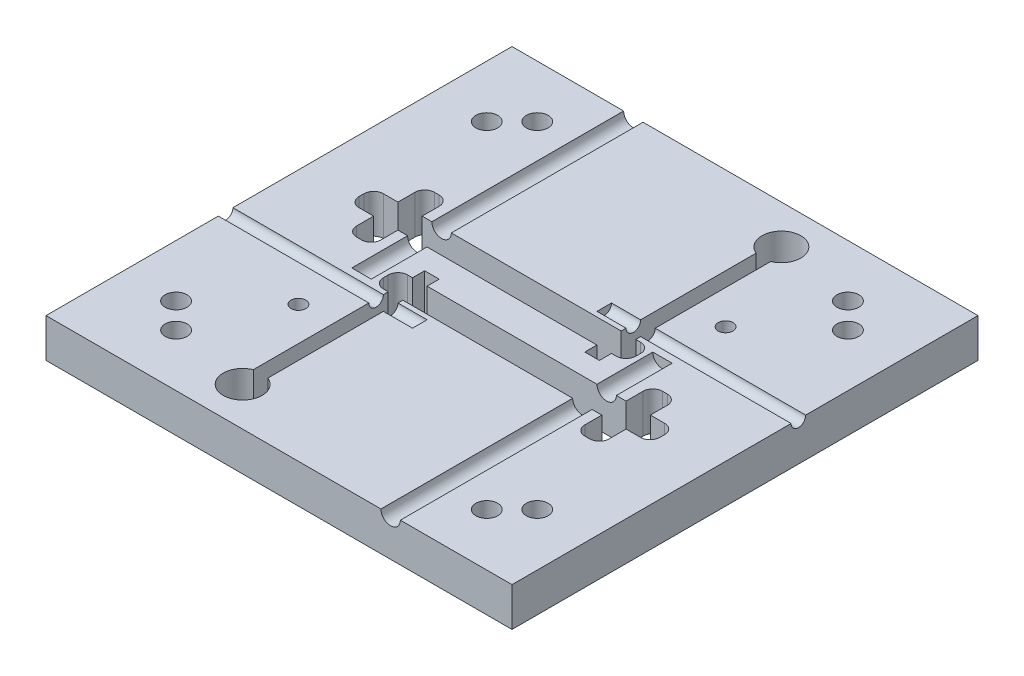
ISO-10303-21;
HEADER;
FILE_DESCRIPTION(('STEP AP214'),'2;1');
FILE_NAME('part.step','',(''),(''),'','','');
FILE_SCHEMA(('AUTOMOTIVE_DESIGN { 1 0 10303 214 1 1 1 1 }'));
ENDSEC;
DATA;
#1=APPLICATION_CONTEXT('core data for automotive mechanical design processes');
#2=APPLICATION_PROTOCOL_DEFINITION('international standard','automotive_design',2000,#1);
#3=PRODUCT_CONTEXT('',#1,'mechanical');
#4=PRODUCT('Part','Part','',(#3));
#5=PRODUCT_RELATED_PRODUCT_CATEGORY('part','',(#4));
#6=PRODUCT_DEFINITION_FORMATION('','',#4);
#7=PRODUCT_DEFINITION_CONTEXT('part definition',#1,'design');
#8=PRODUCT_DEFINITION('design','',#6,#7);
#9=PRODUCT_DEFINITION_SHAPE('','',#8);
#10=(LENGTH_UNIT() NAMED_UNIT(*) SI_UNIT(.MILLI.,.METRE.));
#11=(NAMED_UNIT(*) PLANE_ANGLE_UNIT() SI_UNIT($,.RADIAN.));
#12=(NAMED_UNIT(*) SI_UNIT($,.STERADIAN.) SOLID_ANGLE_UNIT());
#13=UNCERTAINTY_MEASURE_WITH_UNIT(LENGTH_MEASURE(1.E-05),#10,'distance_accuracy_value','');
#14=(GEOMETRIC_REPRESENTATION_CONTEXT(3) GLOBAL_UNCERTAINTY_ASSIGNED_CONTEXT((#13)) GLOBAL_UNIT_ASSIGNED_CONTEXT((#10,
#11,#12)) REPRESENTATION_CONTEXT('',''));
#15=CARTESIAN_POINT('',(0.,0.,0.));
#16=DIRECTION('',(0.,0.,1.));
#17=DIRECTION('',(1.,0.,0.));
#18=AXIS2_PLACEMENT_3D('',#15,#16,#17);
#19=CARTESIAN_POINT('',(-152.4,12.7,-152.4));
#20=DIRECTION('',(0.,-1.,0.));
#21=DIRECTION('',(0.,0.,-1.));
#22=AXIS2_PLACEMENT_3D('',#19,#20,#21);
#23=PLANE('',#22);
#24=CARTESIAN_POINT('',(101.6,12.7,118.11));
#25=DIRECTION('',(0.,-1.,0.));
#26=DIRECTION('',(0.,0.,-1.));
#27=AXIS2_PLACEMENT_3D('',#24,#25,#26);
#28=CIRCLE('',#27,7.1374);
#29=CARTESIAN_POINT('',(101.6,12.7,110.9726));
#30=VERTEX_POINT('',#29);
#31=EDGE_CURVE('E795',#30,#30,#28,.T.);
#32=ORIENTED_EDGE('',*,*,#31,.T.);
#33=EDGE_LOOP('',(#32));
#34=FACE_BOUND('',#33,.T.);
#35=CARTESIAN_POINT('',(-101.6,12.7,-118.11));
#36=DIRECTION('',(0.,1.,0.));
#37=DIRECTION('',(0.,0.,1.));
#38=AXIS2_PLACEMENT_3D('',#35,#36,#37);
#39=CIRCLE('',#38,7.1374);
#40=CARTESIAN_POINT('',(-101.6,12.7,-110.9726));
#41=VERTEX_POINT('',#40);
#42=EDGE_CURVE('E813',#41,#41,#39,.T.);
#43=ORIENTED_EDGE('',*,*,#42,.F.);
#44=EDGE_LOOP('',(#43));
#45=FACE_BOUND('',#44,.T.);
#46=CARTESIAN_POINT('',(-118.11,12.7,-101.6));
#47=DIRECTION('',(0.,1.,0.));
#48=DIRECTION('',(0.,0.,1.));
#49=AXIS2_PLACEMENT_3D('',#46,#47,#48);
#50=CIRCLE('',#49,7.13739999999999);
#51=CARTESIAN_POINT('',(-118.11,12.7,-94.4626));
#52=VERTEX_POINT('',#51);
#53=EDGE_CURVE('E831',#52,#52,#50,.T.);
#54=ORIENTED_EDGE('',*,*,#53,.F.);
#55=EDGE_LOOP('',(#54));
#56=FACE_BOUND('',#55,.T.);
#57=CARTESIAN_POINT('',(118.11,12.7,101.6));
#58=DIRECTION('',(0.,-1.,0.));
#59=DIRECTION('',(0.,0.,-1.));
#60=AXIS2_PLACEMENT_3D('',#57,#58,#59);
#61=CIRCLE('',#60,7.1374);
#62=CARTESIAN_POINT('',(118.11,12.7,94.4626));
#63=VERTEX_POINT('',#62);
#64=EDGE_CURVE('E801',#63,#63,#61,.T.);
#65=ORIENTED_EDGE('',*,*,#64,.T.);
#66=EDGE_LOOP('',(#65));
#67=FACE_BOUND('',#66,.T.);
#68=DIRECTION('',(-1.,0.,0.));
#69=VECTOR('',#68,1.);
#70=CARTESIAN_POINT('',(-25.4,12.7,30.1625));
#71=LINE('',#70,#69);
#72=CARTESIAN_POINT('',(-152.4,12.7,30.1625));
#73=VERTEX_POINT('',#72);
#74=CARTESIAN_POINT('',(-53.975,12.7,30.1625));
#75=VERTEX_POINT('',#74);
#76=EDGE_CURVE('E569',#73,#75,#71,.F.);
#77=ORIENTED_EDGE('',*,*,#76,.T.);
#78=DIRECTION('',(0.,0.,1.));
#79=VECTOR('',#78,1.);
#80=CARTESIAN_POINT('',(-53.975,12.7,130.175));
#81=LINE('',#80,#79);
#82=CARTESIAN_POINT('',(-53.975,12.7,26.9748));
#83=VERTEX_POINT('',#82);
#84=EDGE_CURVE('E552',#83,#75,#81,.T.);
#85=ORIENTED_EDGE('',*,*,#84,.F.);
#86=DIRECTION('',(1.,0.,0.));
#87=VECTOR('',#86,1.);
#88=CARTESIAN_POINT('',(117.348,12.7,26.9748));
#89=LINE('',#88,#87);
#90=CARTESIAN_POINT('',(-57.15,12.7,26.9748));
#91=VERTEX_POINT('',#90);
#92=EDGE_CURVE('E588',#91,#83,#89,.T.);
#93=ORIENTED_EDGE('',*,*,#92,.F.);
#94=CARTESIAN_POINT('',(-57.15,12.7,20.6248));
#95=DIRECTION('',(0.,-1.,0.));
#96=DIRECTION('',(0.,0.,-1.));
#97=AXIS2_PLACEMENT_3D('',#94,#95,#96);
#98=CIRCLE('',#97,6.35);
#99=CARTESIAN_POINT('',(-63.5,12.7,20.6248));
#100=VERTEX_POINT('',#99);
#101=EDGE_CURVE('E1079',#100,#91,#98,.F.);
#102=ORIENTED_EDGE('',*,*,#101,.F.);
#103=DIRECTION('',(0.,0.,1.));
#104=VECTOR('',#103,1.);
#105=CARTESIAN_POINT('',(-63.5,12.7,26.9748));
#106=LINE('',#105,#104);
#107=CARTESIAN_POINT('',(-63.5,12.7,17.4498));
#108=VERTEX_POINT('',#107);
#109=EDGE_CURVE('E571',#108,#100,#106,.T.);
#110=ORIENTED_EDGE('',*,*,#109,.F.);
#111=CARTESIAN_POINT('',(-57.15,12.7,17.4498));
#112=DIRECTION('',(0.,-1.,0.));
#113=DIRECTION('',(0.,0.,-1.));
#114=AXIS2_PLACEMENT_3D('',#111,#112,#113);
#115=CIRCLE('',#114,6.35);
#116=CARTESIAN_POINT('',(-57.15,12.7,11.0998));
#117=VERTEX_POINT('',#116);
#118=EDGE_CURVE('E1071',#117,#108,#115,.F.);
#119=ORIENTED_EDGE('',*,*,#118,.F.);
#120=DIRECTION('',(-1.,0.,0.));
#121=VECTOR('',#120,1.);
#122=CARTESIAN_POINT('',(117.348,12.7,11.0998));
#123=LINE('',#122,#121);
#124=CARTESIAN_POINT('',(-53.975,12.7,11.0998));
#125=VERTEX_POINT('',#124);
#126=EDGE_CURVE('E583',#125,#117,#123,.T.);
#127=ORIENTED_EDGE('',*,*,#126,.F.);
#128=CARTESIAN_POINT('',(-53.975,12.7,3.17500000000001));
#129=VERTEX_POINT('',#128);
#130=EDGE_CURVE('E549',#129,#125,#81,.T.);
#131=ORIENTED_EDGE('',*,*,#130,.F.);
#132=DIRECTION('',(-1.,0.,0.));
#133=VECTOR('',#132,1.);
#134=CARTESIAN_POINT('',(-53.975,12.7,3.17500000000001));
#135=LINE('',#134,#133);
#136=CARTESIAN_POINT('',(-44.45,12.7,3.17500000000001));
#137=VERTEX_POINT('',#136);
#138=EDGE_CURVE('E541',#137,#129,#135,.T.);
#139=ORIENTED_EDGE('',*,*,#138,.F.);
#140=DIRECTION('',(0.,0.,-1.));
#141=VECTOR('',#140,1.);
#142=CARTESIAN_POINT('',(-44.45,12.7,130.175));
#143=LINE('',#142,#141);
#144=CARTESIAN_POINT('',(-44.45,12.7,11.0998));
#145=VERTEX_POINT('',#144);
#146=EDGE_CURVE('E544',#145,#137,#143,.T.);
#147=ORIENTED_EDGE('',*,*,#146,.F.);
#148=CARTESIAN_POINT('',(66.675,12.7,11.0998));
#149=VERTEX_POINT('',#148);
#150=EDGE_CURVE('E1276',#149,#145,#123,.T.);
#151=ORIENTED_EDGE('',*,*,#150,.F.);
#152=DIRECTION('',(0.,0.,1.));
#153=VECTOR('',#152,1.);
#154=CARTESIAN_POINT('',(66.675,12.7,-25.3999999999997));
#155=LINE('',#154,#153);
#156=CARTESIAN_POINT('',(66.675,12.7,-25.3999999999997));
#157=VERTEX_POINT('',#156);
#158=EDGE_CURVE('E643',#149,#157,#155,.F.);
#159=ORIENTED_EDGE('',*,*,#158,.T.);
#160=DIRECTION('',(-1.,0.,0.));
#161=VECTOR('',#160,1.);
#162=CARTESIAN_POINT('',(-152.4,12.7,-25.3999999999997));
#163=LINE('',#162,#161);
#164=CARTESIAN_POINT('',(79.375,12.7,-25.3999999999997));
#165=VERTEX_POINT('',#164);
#166=EDGE_CURVE('E988',#165,#157,#163,.T.);
#167=ORIENTED_EDGE('',*,*,#166,.F.);
#168=DIRECTION('',(0.,0.,1.));
#169=VECTOR('',#168,1.);
#170=CARTESIAN_POINT('',(79.375,12.7,-25.3999999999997));
#171=LINE('',#170,#169);
#172=CARTESIAN_POINT('',(79.375,12.7,11.0998));
#173=VERTEX_POINT('',#172);
#174=EDGE_CURVE('E648',#165,#173,#171,.T.);
#175=ORIENTED_EDGE('',*,*,#174,.T.);
#176=CARTESIAN_POINT('',(85.725,12.7,11.0998));
#177=VERTEX_POINT('',#176);
#178=EDGE_CURVE('E587',#177,#173,#123,.T.);
#179=ORIENTED_EDGE('',*,*,#178,.F.);
#180=DIRECTION('',(0.,0.,1.));
#181=VECTOR('',#180,1.);
#182=CARTESIAN_POINT('',(85.725,12.7,-6.35000000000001));
#183=LINE('',#182,#181);
#184=CARTESIAN_POINT('',(85.725,12.7,0.));
#185=VERTEX_POINT('',#184);
#186=EDGE_CURVE('E617',#185,#177,#183,.T.);
#187=ORIENTED_EDGE('',*,*,#186,.F.);
#188=CARTESIAN_POINT('',(92.075,12.7,0.));
#189=DIRECTION('',(0.,-1.,0.));
#190=DIRECTION('',(0.,0.,-1.));
#191=AXIS2_PLACEMENT_3D('',#188,#189,#190);
#192=CIRCLE('',#191,6.35);
#193=CARTESIAN_POINT('',(92.075,12.7,-6.35000000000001));
#194=VERTEX_POINT('',#193);
#195=EDGE_CURVE('E1000',#194,#185,#192,.F.);
#196=ORIENTED_EDGE('',*,*,#195,.F.);
#197=DIRECTION('',(-1.,0.,0.));
#198=VECTOR('',#197,1.);
#199=CARTESIAN_POINT('',(85.725,12.7,-6.35000000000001));
#200=LINE('',#199,#198);
#201=CARTESIAN_POINT('',(95.25,12.7,-6.35000000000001));
#202=VERTEX_POINT('',#201);
#203=EDGE_CURVE('E626',#202,#194,#200,.T.);
#204=ORIENTED_EDGE('',*,*,#203,.F.);
#205=CARTESIAN_POINT('',(95.25,12.7,0.));
#206=DIRECTION('',(0.,-1.,0.));
#207=DIRECTION('',(0.,0.,-1.));
#208=AXIS2_PLACEMENT_3D('',#205,#206,#207);
#209=CIRCLE('',#208,6.35);
#210=CARTESIAN_POINT('',(101.6,12.7,0.));
#211=VERTEX_POINT('',#210);
#212=EDGE_CURVE('E1011',#211,#202,#209,.F.);
#213=ORIENTED_EDGE('',*,*,#212,.F.);
#214=DIRECTION('',(0.,0.,-1.));
#215=VECTOR('',#214,1.);
#216=CARTESIAN_POINT('',(101.6,12.7,-6.35000000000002));
#217=LINE('',#216,#215);
#218=CARTESIAN_POINT('',(101.6,12.7,11.0998));
#219=VERTEX_POINT('',#218);
#220=EDGE_CURVE('E622',#219,#211,#217,.T.);
#221=ORIENTED_EDGE('',*,*,#220,.F.);
#222=CARTESIAN_POINT('',(110.998,12.7,11.0998));
#223=VERTEX_POINT('',#222);
#224=EDGE_CURVE('E584',#223,#219,#123,.T.);
#225=ORIENTED_EDGE('',*,*,#224,.F.);
#226=CARTESIAN_POINT('',(110.998,12.7,17.4498));
#227=DIRECTION('',(0.,-1.,0.));
#228=DIRECTION('',(0.,0.,-1.));
#229=AXIS2_PLACEMENT_3D('',#226,#227,#228);
#230=CIRCLE('',#229,6.35);
#231=CARTESIAN_POINT('',(117.348,12.7,17.4498));
#232=VERTEX_POINT('',#231);
#233=EDGE_CURVE('E1050',#232,#223,#230,.F.);
#234=ORIENTED_EDGE('',*,*,#233,.F.);
#235=DIRECTION('',(0.,0.,-1.));
#236=VECTOR('',#235,1.);
#237=CARTESIAN_POINT('',(117.348,12.7,26.9748));
#238=LINE('',#237,#236);
#239=CARTESIAN_POINT('',(117.348,12.7,20.6248));
#240=VERTEX_POINT('',#239);
#241=EDGE_CURVE('E581',#240,#232,#238,.T.);
#242=ORIENTED_EDGE('',*,*,#241,.F.);
#243=CARTESIAN_POINT('',(110.998,12.7,20.6248));
#244=DIRECTION('',(0.,-1.,0.));
#245=DIRECTION('',(0.,0.,-1.));
#246=AXIS2_PLACEMENT_3D('',#243,#244,#245);
#247=CIRCLE('',#246,6.35);
#248=CARTESIAN_POINT('',(110.998,12.7,26.9748));
#249=VERTEX_POINT('',#248);
#250=EDGE_CURVE('E1060',#249,#240,#247,.F.);
#251=ORIENTED_EDGE('',*,*,#250,.F.);
#252=CARTESIAN_POINT('',(101.6,12.7,26.9748));
#253=VERTEX_POINT('',#252);
#254=EDGE_CURVE('E586',#253,#249,#89,.T.);
#255=ORIENTED_EDGE('',*,*,#254,.F.);
#256=CARTESIAN_POINT('',(101.6,12.7,38.1));
#257=VERTEX_POINT('',#256);
#258=EDGE_CURVE('E623',#257,#253,#217,.T.);
#259=ORIENTED_EDGE('',*,*,#258,.F.);
#260=CARTESIAN_POINT('',(95.25,12.7,38.1));
#261=DIRECTION('',(0.,-1.,0.));
#262=DIRECTION('',(0.,0.,-1.));
#263=AXIS2_PLACEMENT_3D('',#260,#261,#262);
#264=CIRCLE('',#263,6.35);
#265=CARTESIAN_POINT('',(95.25,12.7,44.45));
#266=VERTEX_POINT('',#265);
#267=EDGE_CURVE('E1019',#266,#257,#264,.F.);
#268=ORIENTED_EDGE('',*,*,#267,.F.);
#269=DIRECTION('',(1.,0.,0.));
#270=VECTOR('',#269,1.);
#271=CARTESIAN_POINT('',(85.725,12.7,44.45));
#272=LINE('',#271,#270);
#273=CARTESIAN_POINT('',(92.075,12.7,44.45));
#274=VERTEX_POINT('',#273);
#275=EDGE_CURVE('E620',#274,#266,#272,.T.);
#276=ORIENTED_EDGE('',*,*,#275,.F.);
#277=CARTESIAN_POINT('',(92.075,12.7,38.1));
#278=DIRECTION('',(0.,-1.,0.));
#279=DIRECTION('',(0.,0.,-1.));
#280=AXIS2_PLACEMENT_3D('',#277,#278,#279);
#281=CIRCLE('',#280,6.35);
#282=CARTESIAN_POINT('',(85.725,12.7,38.1));
#283=VERTEX_POINT('',#282);
#284=EDGE_CURVE('E1030',#283,#274,#281,.F.);
#285=ORIENTED_EDGE('',*,*,#284,.F.);
#286=CARTESIAN_POINT('',(85.725,12.7,26.9748));
#287=VERTEX_POINT('',#286);
#288=EDGE_CURVE('E616',#287,#283,#183,.T.);
#289=ORIENTED_EDGE('',*,*,#288,.F.);
#290=CARTESIAN_POINT('',(79.375,12.7,26.9748));
#291=VERTEX_POINT('',#290);
#292=EDGE_CURVE('E593',#291,#287,#89,.T.);
#293=ORIENTED_EDGE('',*,*,#292,.F.);
#294=CARTESIAN_POINT('',(79.375,12.7,152.4));
#295=VERTEX_POINT('',#294);
#296=EDGE_CURVE('E647',#291,#295,#171,.T.);
#297=ORIENTED_EDGE('',*,*,#296,.T.);
#298=DIRECTION('',(1.,0.,0.));
#299=VECTOR('',#298,1.);
#300=CARTESIAN_POINT('',(-152.4,12.7,152.4));
#301=LINE('',#300,#299);
#302=CARTESIAN_POINT('',(152.4,12.7,152.4));
#303=VERTEX_POINT('',#302);
#304=EDGE_CURVE('E850',#295,#303,#301,.T.);
#305=ORIENTED_EDGE('',*,*,#304,.T.);
#306=DIRECTION('',(0.,0.,-1.));
#307=VECTOR('',#306,1.);
#308=CARTESIAN_POINT('',(152.4,12.7,152.4));
#309=LINE('',#308,#307);
#310=CARTESIAN_POINT('',(152.4,12.7,-30.1625));
#311=VERTEX_POINT('',#310);
#312=EDGE_CURVE('E855',#303,#311,#309,.T.);
#313=ORIENTED_EDGE('',*,*,#312,.T.);
#314=DIRECTION('',(1.,0.,0.));
#315=VECTOR('',#314,1.);
#316=CARTESIAN_POINT('',(25.4,12.7,-30.1625));
#317=LINE('',#316,#315);
#318=CARTESIAN_POINT('',(53.975,12.7,-30.1625));
#319=VERTEX_POINT('',#318);
#320=EDGE_CURVE('E720',#311,#319,#317,.F.);
#321=ORIENTED_EDGE('',*,*,#320,.T.);
#322=DIRECTION('',(0.,0.,1.));
#323=VECTOR('',#322,1.);
#324=CARTESIAN_POINT('',(53.975,12.7,-152.4));
#325=LINE('',#324,#323);
#326=CARTESIAN_POINT('',(53.975,12.7,-26.9748));
#327=VERTEX_POINT('',#326);
#328=EDGE_CURVE('E702',#319,#327,#325,.T.);
#329=ORIENTED_EDGE('',*,*,#328,.T.);
#330=DIRECTION('',(-1.,0.,0.));
#331=VECTOR('',#330,1.);
#332=CARTESIAN_POINT('',(-117.475,12.7,-26.9748));
#333=LINE('',#332,#331);
#334=CARTESIAN_POINT('',(57.1499999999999,12.7,-26.9748));
#335=VERTEX_POINT('',#334);
#336=EDGE_CURVE('E740',#335,#327,#333,.T.);
#337=ORIENTED_EDGE('',*,*,#336,.F.);
#338=CARTESIAN_POINT('',(57.15,12.7,-20.6248));
#339=DIRECTION('',(0.,-1.,0.));
#340=DIRECTION('',(0.,0.,-1.));
#341=AXIS2_PLACEMENT_3D('',#338,#339,#340);
#342=CIRCLE('',#341,6.35);
#343=CARTESIAN_POINT('',(63.5,12.7,-20.6248));
#344=VERTEX_POINT('',#343);
#345=EDGE_CURVE('E955',#344,#335,#342,.F.);
#346=ORIENTED_EDGE('',*,*,#345,.F.);
#347=DIRECTION('',(0.,0.,-1.));
#348=VECTOR('',#347,1.);
#349=CARTESIAN_POINT('',(63.5,12.7,-11.0998));
#350=LINE('',#349,#348);
#351=CARTESIAN_POINT('',(63.5,12.7,-17.4498));
#352=VERTEX_POINT('',#351);
#353=EDGE_CURVE('E727',#352,#344,#350,.T.);
#354=ORIENTED_EDGE('',*,*,#353,.F.);
#355=CARTESIAN_POINT('',(57.15,12.7,-17.4498));
#356=DIRECTION('',(0.,-1.,0.));
#357=DIRECTION('',(0.,0.,-1.));
#358=AXIS2_PLACEMENT_3D('',#355,#356,#357);
#359=CIRCLE('',#358,6.35);
#360=CARTESIAN_POINT('',(57.1499999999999,12.7,-11.0998));
#361=VERTEX_POINT('',#360);
#362=EDGE_CURVE('E966',#361,#352,#359,.F.);
#363=ORIENTED_EDGE('',*,*,#362,.F.);
#364=DIRECTION('',(1.,0.,0.));
#365=VECTOR('',#364,1.);
#366=CARTESIAN_POINT('',(-117.475,12.7,-11.0998));
#367=LINE('',#366,#365);
#368=CARTESIAN_POINT('',(53.975,12.7,-11.0998));
#369=VERTEX_POINT('',#368);
#370=EDGE_CURVE('E734',#369,#361,#367,.T.);
#371=ORIENTED_EDGE('',*,*,#370,.F.);
#372=CARTESIAN_POINT('',(53.975,12.7,-3.175));
#373=VERTEX_POINT('',#372);
#374=EDGE_CURVE('E706',#369,#373,#325,.T.);
#375=ORIENTED_EDGE('',*,*,#374,.T.);
#376=DIRECTION('',(-1.,0.,0.));
#377=VECTOR('',#376,1.);
#378=CARTESIAN_POINT('',(-152.4,12.7,-3.17500000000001));
#379=LINE('',#378,#377);
#380=CARTESIAN_POINT('',(44.45,12.7,-3.175));
#381=VERTEX_POINT('',#380);
#382=EDGE_CURVE('E713',#373,#381,#379,.T.);
#383=ORIENTED_EDGE('',*,*,#382,.T.);
#384=DIRECTION('',(0.,0.,-1.));
#385=VECTOR('',#384,1.);
#386=CARTESIAN_POINT('',(44.45,12.7,-152.4));
#387=LINE('',#386,#385);
#388=CARTESIAN_POINT('',(44.45,12.7,-11.0998));
#389=VERTEX_POINT('',#388);
#390=EDGE_CURVE('E695',#381,#389,#387,.T.);
#391=ORIENTED_EDGE('',*,*,#390,.T.);
#392=CARTESIAN_POINT('',(-66.675,12.7,-11.0998));
#393=VERTEX_POINT('',#392);
#394=EDGE_CURVE('E739',#393,#389,#367,.T.);
#395=ORIENTED_EDGE('',*,*,#394,.F.);
#396=DIRECTION('',(0.,0.,-1.));
#397=VECTOR('',#396,1.);
#398=CARTESIAN_POINT('',(-66.675,12.7,25.4000000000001));
#399=LINE('',#398,#397);
#400=CARTESIAN_POINT('',(-66.675,12.7,25.4000000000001));
#401=VERTEX_POINT('',#400);
#402=EDGE_CURVE('E656',#393,#401,#399,.F.);
#403=ORIENTED_EDGE('',*,*,#402,.T.);
#404=DIRECTION('',(1.,0.,0.));
#405=VECTOR('',#404,1.);
#406=CARTESIAN_POINT('',(-152.4,12.7,25.4000000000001));
#407=LINE('',#406,#405);
#408=CARTESIAN_POINT('',(-79.375,12.7,25.4000000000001));
#409=VERTEX_POINT('',#408);
#410=EDGE_CURVE('E983',#409,#401,#407,.T.);
#411=ORIENTED_EDGE('',*,*,#410,.F.);
#412=DIRECTION('',(0.,0.,-1.));
#413=VECTOR('',#412,1.);
#414=CARTESIAN_POINT('',(-79.375,12.7,25.4000000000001));
#415=LINE('',#414,#413);
#416=CARTESIAN_POINT('',(-79.375,12.7,-11.0998));
#417=VERTEX_POINT('',#416);
#418=EDGE_CURVE('E659',#409,#417,#415,.T.);
#419=ORIENTED_EDGE('',*,*,#418,.T.);
#420=CARTESIAN_POINT('',(-85.725,12.7,-11.0998));
#421=VERTEX_POINT('',#420);
#422=EDGE_CURVE('E738',#421,#417,#367,.T.);
#423=ORIENTED_EDGE('',*,*,#422,.F.);
#424=DIRECTION('',(0.,0.,-1.));
#425=VECTOR('',#424,1.);
#426=CARTESIAN_POINT('',(-85.725,12.7,-44.45));
#427=LINE('',#426,#425);
#428=CARTESIAN_POINT('',(-85.725,12.7,0.));
#429=VERTEX_POINT('',#428);
#430=EDGE_CURVE('E771',#429,#421,#427,.T.);
#431=ORIENTED_EDGE('',*,*,#430,.F.);
#432=CARTESIAN_POINT('',(-92.075,12.7,0.));
#433=DIRECTION('',(0.,-1.,0.));
#434=DIRECTION('',(0.,0.,-1.));
#435=AXIS2_PLACEMENT_3D('',#432,#433,#434);
#436=CIRCLE('',#435,6.35);
#437=CARTESIAN_POINT('',(-92.075,12.7,6.35000000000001));
#438=VERTEX_POINT('',#437);
#439=EDGE_CURVE('E915',#438,#429,#436,.F.);
#440=ORIENTED_EDGE('',*,*,#439,.F.);
#441=DIRECTION('',(1.,0.,0.));
#442=VECTOR('',#441,1.);
#443=CARTESIAN_POINT('',(-101.6,12.7,6.35000000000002));
#444=LINE('',#443,#442);
#445=CARTESIAN_POINT('',(-95.25,12.7,6.35000000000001));
#446=VERTEX_POINT('',#445);
#447=EDGE_CURVE('E767',#446,#438,#444,.T.);
#448=ORIENTED_EDGE('',*,*,#447,.F.);
#449=CARTESIAN_POINT('',(-95.25,12.7,0.));
#450=DIRECTION('',(0.,-1.,0.));
#451=DIRECTION('',(0.,0.,-1.));
#452=AXIS2_PLACEMENT_3D('',#449,#450,#451);
#453=CIRCLE('',#452,6.35);
#454=CARTESIAN_POINT('',(-101.6,12.7,0.));
#455=VERTEX_POINT('',#454);
#456=EDGE_CURVE('E902',#455,#446,#453,.F.);
#457=ORIENTED_EDGE('',*,*,#456,.F.);
#458=DIRECTION('',(0.,0.,1.));
#459=VECTOR('',#458,1.);
#460=CARTESIAN_POINT('',(-101.6,12.7,-44.45));
#461=LINE('',#460,#459);
#462=CARTESIAN_POINT('',(-101.6,12.7,-11.0998));
#463=VERTEX_POINT('',#462);
#464=EDGE_CURVE('E763',#463,#455,#461,.T.);
#465=ORIENTED_EDGE('',*,*,#464,.F.);
#466=CARTESIAN_POINT('',(-111.125,12.7,-11.0998));
#467=VERTEX_POINT('',#466);
#468=EDGE_CURVE('E735',#467,#463,#367,.T.);
#469=ORIENTED_EDGE('',*,*,#468,.F.);
#470=CARTESIAN_POINT('',(-111.125,12.7,-17.4498));
#471=DIRECTION('',(0.,-1.,0.));
#472=DIRECTION('',(0.,0.,-1.));
#473=AXIS2_PLACEMENT_3D('',#470,#471,#472);
#474=CIRCLE('',#473,6.35);
#475=CARTESIAN_POINT('',(-117.475,12.7,-17.4498));
#476=VERTEX_POINT('',#475);
#477=EDGE_CURVE('E939',#476,#467,#474,.F.);
#478=ORIENTED_EDGE('',*,*,#477,.F.);
#479=DIRECTION('',(0.,0.,1.));
#480=VECTOR('',#479,1.);
#481=CARTESIAN_POINT('',(-117.475,12.7,-11.0998));
#482=LINE('',#481,#480);
#483=CARTESIAN_POINT('',(-117.475,12.7,-20.6248));
#484=VERTEX_POINT('',#483);
#485=EDGE_CURVE('E731',#484,#476,#482,.T.);
#486=ORIENTED_EDGE('',*,*,#485,.F.);
#487=CARTESIAN_POINT('',(-111.125,12.7,-20.6248));
#488=DIRECTION('',(0.,-1.,0.));
#489=DIRECTION('',(0.,0.,-1.));
#490=AXIS2_PLACEMENT_3D('',#487,#488,#489);
#491=CIRCLE('',#490,6.35);
#492=CARTESIAN_POINT('',(-111.125,12.7,-26.9748));
#493=VERTEX_POINT('',#492);
#494=EDGE_CURVE('E931',#493,#484,#491,.F.);
#495=ORIENTED_EDGE('',*,*,#494,.F.);
#496=CARTESIAN_POINT('',(-101.6,12.7,-26.9748));
#497=VERTEX_POINT('',#496);
#498=EDGE_CURVE('E737',#497,#493,#333,.T.);
#499=ORIENTED_EDGE('',*,*,#498,.F.);
#500=CARTESIAN_POINT('',(-101.6,12.7,-38.1));
#501=VERTEX_POINT('',#500);
#502=EDGE_CURVE('E764',#501,#497,#461,.T.);
#503=ORIENTED_EDGE('',*,*,#502,.F.);
#504=CARTESIAN_POINT('',(-95.25,12.7,-38.1));
#505=DIRECTION('',(0.,-1.,0.));
#506=DIRECTION('',(0.,0.,-1.));
#507=AXIS2_PLACEMENT_3D('',#504,#505,#506);
#508=CIRCLE('',#507,6.35);
#509=CARTESIAN_POINT('',(-95.25,12.7,-44.45));
#510=VERTEX_POINT('',#509);
#511=EDGE_CURVE('E880',#510,#501,#508,.F.);
#512=ORIENTED_EDGE('',*,*,#511,.F.);
#513=DIRECTION('',(-1.,0.,0.));
#514=VECTOR('',#513,1.);
#515=CARTESIAN_POINT('',(-101.6,12.7,-44.45));
#516=LINE('',#515,#514);
#517=CARTESIAN_POINT('',(-92.075,12.7,-44.45));
#518=VERTEX_POINT('',#517);
#519=EDGE_CURVE('E774',#518,#510,#516,.T.);
#520=ORIENTED_EDGE('',*,*,#519,.F.);
#521=CARTESIAN_POINT('',(-92.075,12.7,-38.1));
#522=DIRECTION('',(0.,-1.,0.));
#523=DIRECTION('',(0.,0.,-1.));
#524=AXIS2_PLACEMENT_3D('',#521,#522,#523);
#525=CIRCLE('',#524,6.35);
#526=CARTESIAN_POINT('',(-85.725,12.7,-38.1));
#527=VERTEX_POINT('',#526);
#528=EDGE_CURVE('E891',#527,#518,#525,.F.);
#529=ORIENTED_EDGE('',*,*,#528,.F.);
#530=CARTESIAN_POINT('',(-85.725,12.7,-26.9748));
#531=VERTEX_POINT('',#530);
#532=EDGE_CURVE('E770',#531,#527,#427,.T.);
#533=ORIENTED_EDGE('',*,*,#532,.F.);
#534=CARTESIAN_POINT('',(-79.375,12.7,-26.9748));
#535=VERTEX_POINT('',#534);
#536=EDGE_CURVE('E745',#535,#531,#333,.T.);
#537=ORIENTED_EDGE('',*,*,#536,.F.);
#538=CARTESIAN_POINT('',(-79.375,12.7,-152.4));
#539=VERTEX_POINT('',#538);
#540=EDGE_CURVE('E664',#535,#539,#415,.T.);
#541=ORIENTED_EDGE('',*,*,#540,.T.);
#542=DIRECTION('',(-1.,0.,0.));
#543=VECTOR('',#542,1.);
#544=CARTESIAN_POINT('',(-152.4,12.7,-152.4));
#545=LINE('',#544,#543);
#546=CARTESIAN_POINT('',(-152.4,12.7,-152.4));
#547=VERTEX_POINT('',#546);
#548=EDGE_CURVE('E858',#539,#547,#545,.T.);
#549=ORIENTED_EDGE('',*,*,#548,.T.);
#550=DIRECTION('',(0.,0.,1.));
#551=VECTOR('',#550,1.);
#552=CARTESIAN_POINT('',(-152.4,12.7,152.4));
#553=LINE('',#552,#551);
#554=EDGE_CURVE('E847',#547,#73,#553,.T.);
#555=ORIENTED_EDGE('',*,*,#554,.T.);
#556=EDGE_LOOP('',(#77,#85,#93,#102,#110,#119,#127,#131,#139,#147,#151,#159,#167,#175,#179,#187,
#196,#204,#213,#221,#225,#234,#242,#251,#255,#259,#268,#276,#285,#289,#293,#297,#305,#313,#321,
#329,#337,#346,#354,#363,#371,#375,#383,#391,#395,#403,#411,#419,#423,#431,#440,#448,#457,#465,
#469,#478,#486,#495,#499,#503,#512,#520,#529,#533,#537,#541,#549,#555));
#557=FACE_BOUND('',#556,.T.);
#558=ADVANCED_FACE('F48',(#34,#45,#56,#67,#557),#23,.F.);
#559=CARTESIAN_POINT('',(117.348,-12.7,26.9748));
#560=DIRECTION('',(0.,0.,1.));
#561=DIRECTION('',(1.,0.,0.));
#562=AXIS2_PLACEMENT_3D('',#559,#560,#561);
#563=PLANE('',#562);
#564=ORIENTED_EDGE('',*,*,#92,.T.);
#565=DIRECTION('',(0.,-1.,0.));
#566=VECTOR('',#565,1.);
#567=CARTESIAN_POINT('',(-53.975,-12.7,26.9748));
#568=LINE('',#567,#566);
#569=CARTESIAN_POINT('',(-53.975,-12.7,26.9748));
#570=VERTEX_POINT('',#569);
#571=EDGE_CURVE('E1258',#83,#570,#568,.T.);
#572=ORIENTED_EDGE('',*,*,#571,.T.);
#573=DIRECTION('',(1.,0.,0.));
#574=VECTOR('',#573,1.);
#575=CARTESIAN_POINT('',(117.348,-12.7,26.9748));
#576=LINE('',#575,#574);
#577=CARTESIAN_POINT('',(-57.15,-12.7,26.9748));
#578=VERTEX_POINT('',#577);
#579=EDGE_CURVE('E600',#578,#570,#576,.T.);
#580=ORIENTED_EDGE('',*,*,#579,.F.);
#581=DIRECTION('',(0.,-1.,0.));
#582=VECTOR('',#581,1.);
#583=CARTESIAN_POINT('',(-57.15,-12.7,26.9748));
#584=LINE('',#583,#582);
#585=EDGE_CURVE('E1076',#578,#91,#584,.F.);
#586=ORIENTED_EDGE('',*,*,#585,.T.);
#587=EDGE_LOOP('',(#564,#572,#580,#586));
#588=FACE_BOUND('',#587,.T.);
#589=ADVANCED_FACE('F1256',(#588),#563,.F.);
#590=CARTESIAN_POINT('',(117.348,-12.7,11.0998));
#591=DIRECTION('',(0.,0.,-1.));
#592=DIRECTION('',(-1.,0.,0.));
#593=AXIS2_PLACEMENT_3D('',#590,#591,#592);
#594=PLANE('',#593);
#595=DIRECTION('',(-1.,0.,0.));
#596=VECTOR('',#595,1.);
#597=CARTESIAN_POINT('',(117.348,-12.7,11.0998));
#598=LINE('',#597,#596);
#599=CARTESIAN_POINT('',(-53.975,-12.7,11.0998));
#600=VERTEX_POINT('',#599);
#601=CARTESIAN_POINT('',(-57.15,-12.7,11.0998));
#602=VERTEX_POINT('',#601);
#603=EDGE_CURVE('E595',#600,#602,#598,.T.);
#604=ORIENTED_EDGE('',*,*,#603,.F.);
#605=DIRECTION('',(0.,1.,0.));
#606=VECTOR('',#605,1.);
#607=CARTESIAN_POINT('',(-53.975,-12.7,11.0998));
#608=LINE('',#607,#606);
#609=EDGE_CURVE('E1275',#600,#125,#608,.T.);
#610=ORIENTED_EDGE('',*,*,#609,.T.);
#611=ORIENTED_EDGE('',*,*,#126,.T.);
#612=DIRECTION('',(0.,1.,0.));
#613=VECTOR('',#612,1.);
#614=CARTESIAN_POINT('',(-57.15,-12.7,11.0998));
#615=LINE('',#614,#613);
#616=EDGE_CURVE('E1065',#117,#602,#615,.F.);
#617=ORIENTED_EDGE('',*,*,#616,.T.);
#618=EDGE_LOOP('',(#604,#610,#611,#617));
#619=FACE_BOUND('',#618,.T.);
#620=ADVANCED_FACE('F1274',(#619),#594,.F.);
#621=CARTESIAN_POINT('',(-25.4,12.7,34.925));
#622=DIRECTION('',(-1.,0.,0.));
#623=DIRECTION('',(0.,0.,1.));
#624=AXIS2_PLACEMENT_3D('',#621,#622,#623);
#625=CYLINDRICAL_SURFACE('',#624,4.7625);
#626=DIRECTION('',(-1.,0.,0.));
#627=VECTOR('',#626,1.);
#628=CARTESIAN_POINT('',(-25.4,12.7,39.6875));
#629=LINE('',#628,#627);
#630=CARTESIAN_POINT('',(-53.975,12.7,39.6875));
#631=VERTEX_POINT('',#630);
#632=CARTESIAN_POINT('',(-152.4,12.7,39.6875));
#633=VERTEX_POINT('',#632);
#634=EDGE_CURVE('E561',#631,#633,#629,.T.);
#635=ORIENTED_EDGE('',*,*,#634,.F.);
#636=CARTESIAN_POINT('',(-53.975,12.7,34.925));
#637=DIRECTION('',(-1.,0.,0.));
#638=DIRECTION('',(0.,0.,1.));
#639=AXIS2_PLACEMENT_3D('',#636,#637,#638);
#640=CIRCLE('',#639,4.7625);
#641=EDGE_CURVE('E56',#631,#75,#640,.F.);
#642=ORIENTED_EDGE('',*,*,#641,.T.);
#643=ORIENTED_EDGE('',*,*,#76,.F.);
#644=CARTESIAN_POINT('',(-152.4,12.7,34.925));
#645=DIRECTION('',(1.,0.,0.));
#646=DIRECTION('',(0.,0.,-1.));
#647=AXIS2_PLACEMENT_3D('',#644,#645,#646);
#648=CIRCLE('',#647,4.7625);
#649=EDGE_CURVE('E567',#633,#73,#648,.T.);
#650=ORIENTED_EDGE('',*,*,#649,.F.);
#651=EDGE_LOOP('',(#635,#642,#643,#650));
#652=FACE_BOUND('',#651,.T.);
#653=ADVANCED_FACE('F564',(#652),#625,.F.);
#654=CARTESIAN_POINT('',(-57.15,-12.7,20.6248));
#655=DIRECTION('',(0.,1.,0.));
#656=DIRECTION('',(0.,0.,1.));
#657=AXIS2_PLACEMENT_3D('',#654,#655,#656);
#658=CYLINDRICAL_SURFACE('',#657,6.35);
#659=DIRECTION('',(0.,-1.,0.));
#660=VECTOR('',#659,1.);
#661=CARTESIAN_POINT('',(-63.5,-12.7,20.6248));
#662=LINE('',#661,#660);
#663=CARTESIAN_POINT('',(-63.5,-12.7,20.6248));
#664=VERTEX_POINT('',#663);
#665=EDGE_CURVE('E1073',#100,#664,#662,.T.);
#666=ORIENTED_EDGE('',*,*,#665,.F.);
#667=ORIENTED_EDGE('',*,*,#101,.T.);
#668=ORIENTED_EDGE('',*,*,#585,.F.);
#669=CARTESIAN_POINT('',(-57.15,-12.7,20.6248));
#670=DIRECTION('',(0.,-1.,0.));
#671=DIRECTION('',(0.,0.,-1.));
#672=AXIS2_PLACEMENT_3D('',#669,#670,#671);
#673=CIRCLE('',#672,6.35);
#674=EDGE_CURVE('E1081',#578,#664,#673,.T.);
#675=ORIENTED_EDGE('',*,*,#674,.T.);
#676=EDGE_LOOP('',(#666,#667,#668,#675));
#677=FACE_BOUND('',#676,.T.);
#678=ADVANCED_FACE('F50',(#677),#658,.F.);
#679=CARTESIAN_POINT('',(-57.15,-12.7,17.4498));
#680=DIRECTION('',(0.,-1.,0.));
#681=DIRECTION('',(0.,0.,-1.));
#682=AXIS2_PLACEMENT_3D('',#679,#680,#681);
#683=CYLINDRICAL_SURFACE('',#682,6.35);
#684=DIRECTION('',(0.,1.,0.));
#685=VECTOR('',#684,1.);
#686=CARTESIAN_POINT('',(-63.5,-12.7,17.4498));
#687=LINE('',#686,#685);
#688=CARTESIAN_POINT('',(-63.5,-12.7,17.4498));
#689=VERTEX_POINT('',#688);
#690=EDGE_CURVE('E1062',#689,#108,#687,.T.);
#691=ORIENTED_EDGE('',*,*,#690,.F.);
#692=CARTESIAN_POINT('',(-57.15,-12.7,17.4498));
#693=DIRECTION('',(0.,-1.,0.));
#694=DIRECTION('',(0.,0.,-1.));
#695=AXIS2_PLACEMENT_3D('',#692,#693,#694);
#696=CIRCLE('',#695,6.35);
#697=EDGE_CURVE('E1068',#689,#602,#696,.T.);
#698=ORIENTED_EDGE('',*,*,#697,.T.);
#699=ORIENTED_EDGE('',*,*,#616,.F.);
#700=ORIENTED_EDGE('',*,*,#118,.T.);
#701=EDGE_LOOP('',(#691,#698,#699,#700));
#702=FACE_BOUND('',#701,.T.);
#703=ADVANCED_FACE('F1271',(#702),#683,.F.);
#704=CARTESIAN_POINT('',(110.998,-12.7,20.6248));
#705=DIRECTION('',(0.,-1.,0.));
#706=DIRECTION('',(0.,0.,-1.));
#707=AXIS2_PLACEMENT_3D('',#704,#705,#706);
#708=CYLINDRICAL_SURFACE('',#707,6.35);
#709=DIRECTION('',(0.,1.,0.));
#710=VECTOR('',#709,1.);
#711=CARTESIAN_POINT('',(117.348,-12.7,20.6248));
#712=LINE('',#711,#710);
#713=CARTESIAN_POINT('',(117.348,-12.7,20.6248));
#714=VERTEX_POINT('',#713);
#715=EDGE_CURVE('E1052',#714,#240,#712,.T.);
#716=ORIENTED_EDGE('',*,*,#715,.F.);
#717=CARTESIAN_POINT('',(110.998,-12.7,20.6248));
#718=DIRECTION('',(0.,-1.,0.));
#719=DIRECTION('',(0.,0.,-1.));
#720=AXIS2_PLACEMENT_3D('',#717,#718,#719);
#721=CIRCLE('',#720,6.35);
#722=CARTESIAN_POINT('',(110.998,-12.7,26.9748));
#723=VERTEX_POINT('',#722);
#724=EDGE_CURVE('E1058',#714,#723,#721,.T.);
#725=ORIENTED_EDGE('',*,*,#724,.T.);
#726=DIRECTION('',(0.,1.,0.));
#727=VECTOR('',#726,1.);
#728=CARTESIAN_POINT('',(110.998,-12.7,26.9748));
#729=LINE('',#728,#727);
#730=EDGE_CURVE('E1055',#249,#723,#729,.F.);
#731=ORIENTED_EDGE('',*,*,#730,.F.);
#732=ORIENTED_EDGE('',*,*,#250,.T.);
#733=EDGE_LOOP('',(#716,#725,#731,#732));
#734=FACE_BOUND('',#733,.T.);
#735=ADVANCED_FACE('F1405',(#734),#708,.F.);
#736=CARTESIAN_POINT('',(110.998,-12.7,17.4498));
#737=DIRECTION('',(0.,-1.,0.));
#738=DIRECTION('',(0.,0.,-1.));
#739=AXIS2_PLACEMENT_3D('',#736,#737,#738);
#740=CYLINDRICAL_SURFACE('',#739,6.35);
#741=DIRECTION('',(0.,1.,0.));
#742=VECTOR('',#741,1.);
#743=CARTESIAN_POINT('',(110.998,-12.7,11.0998));
#744=LINE('',#743,#742);
#745=CARTESIAN_POINT('',(110.998,-12.7,11.0998));
#746=VERTEX_POINT('',#745);
#747=EDGE_CURVE('E1041',#746,#223,#744,.T.);
#748=ORIENTED_EDGE('',*,*,#747,.F.);
#749=CARTESIAN_POINT('',(110.998,-12.7,17.4498));
#750=DIRECTION('',(0.,-1.,0.));
#751=DIRECTION('',(0.,0.,-1.));
#752=AXIS2_PLACEMENT_3D('',#749,#750,#751);
#753=CIRCLE('',#752,6.35);
#754=CARTESIAN_POINT('',(117.348,-12.7,17.4498));
#755=VERTEX_POINT('',#754);
#756=EDGE_CURVE('E1047',#746,#755,#753,.T.);
#757=ORIENTED_EDGE('',*,*,#756,.T.);
#758=DIRECTION('',(0.,1.,0.));
#759=VECTOR('',#758,1.);
#760=CARTESIAN_POINT('',(117.348,-12.7,17.4498));
#761=LINE('',#760,#759);
#762=EDGE_CURVE('E1044',#232,#755,#761,.F.);
#763=ORIENTED_EDGE('',*,*,#762,.F.);
#764=ORIENTED_EDGE('',*,*,#233,.T.);
#765=EDGE_LOOP('',(#748,#757,#763,#764));
#766=FACE_BOUND('',#765,.T.);
#767=ADVANCED_FACE('F1401',(#766),#740,.F.);
#768=CARTESIAN_POINT('',(73.025,12.7,-25.3999999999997));
#769=DIRECTION('',(0.,0.,1.));
#770=DIRECTION('',(1.,0.,0.));
#771=AXIS2_PLACEMENT_3D('',#768,#769,#770);
#772=CYLINDRICAL_SURFACE('',#771,6.35);
#773=ORIENTED_EDGE('',*,*,#296,.F.);
#774=CARTESIAN_POINT('',(73.025,12.7,26.9748));
#775=DIRECTION('',(0.,0.,1.));
#776=DIRECTION('',(1.,0.,0.));
#777=AXIS2_PLACEMENT_3D('',#774,#775,#776);
#778=CIRCLE('',#777,6.35);
#779=CARTESIAN_POINT('',(66.675,12.7,26.9748));
#780=VERTEX_POINT('',#779);
#781=EDGE_CURVE('E613',#291,#780,#778,.F.);
#782=ORIENTED_EDGE('',*,*,#781,.T.);
#783=CARTESIAN_POINT('',(66.675,12.7,152.4));
#784=VERTEX_POINT('',#783);
#785=EDGE_CURVE('E644',#784,#780,#155,.F.);
#786=ORIENTED_EDGE('',*,*,#785,.F.);
#787=CARTESIAN_POINT('',(73.025,12.7,152.4));
#788=DIRECTION('',(0.,0.,-1.));
#789=DIRECTION('',(-1.,0.,0.));
#790=AXIS2_PLACEMENT_3D('',#787,#788,#789);
#791=CIRCLE('',#790,6.35);
#792=EDGE_CURVE('E985',#295,#784,#791,.T.);
#793=ORIENTED_EDGE('',*,*,#792,.F.);
#794=EDGE_LOOP('',(#773,#782,#786,#793));
#795=FACE_BOUND('',#794,.T.);
#796=ADVANCED_FACE('F1132',(#795),#772,.F.);
#797=CARTESIAN_POINT('',(85.725,-12.7,-6.35000000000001));
#798=DIRECTION('',(-1.,0.,0.));
#799=DIRECTION('',(0.,0.,1.));
#800=AXIS2_PLACEMENT_3D('',#797,#798,#799);
#801=PLANE('',#800);
#802=DIRECTION('',(0.,0.,1.));
#803=VECTOR('',#802,1.);
#804=CARTESIAN_POINT('',(85.725,-12.7,-6.35000000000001));
#805=LINE('',#804,#803);
#806=CARTESIAN_POINT('',(85.725,-12.7,26.9748));
#807=VERTEX_POINT('',#806);
#808=CARTESIAN_POINT('',(85.725,-12.7,38.1));
#809=VERTEX_POINT('',#808);
#810=EDGE_CURVE('E628',#807,#809,#805,.T.);
#811=ORIENTED_EDGE('',*,*,#810,.F.);
#812=DIRECTION('',(0.,1.,0.));
#813=VECTOR('',#812,1.);
#814=CARTESIAN_POINT('',(85.725,-12.7,26.9748));
#815=LINE('',#814,#813);
#816=EDGE_CURVE('E610',#807,#287,#815,.T.);
#817=ORIENTED_EDGE('',*,*,#816,.T.);
#818=ORIENTED_EDGE('',*,*,#288,.T.);
#819=DIRECTION('',(0.,-1.,0.));
#820=VECTOR('',#819,1.);
#821=CARTESIAN_POINT('',(85.725,-12.7,38.1));
#822=LINE('',#821,#820);
#823=EDGE_CURVE('E1024',#283,#809,#822,.T.);
#824=ORIENTED_EDGE('',*,*,#823,.T.);
#825=EDGE_LOOP('',(#811,#817,#818,#824));
#826=FACE_BOUND('',#825,.T.);
#827=ADVANCED_FACE('F1126',(#826),#801,.F.);
#828=CARTESIAN_POINT('',(101.6,-12.7,-6.35000000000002));
#829=DIRECTION('',(1.,0.,0.));
#830=DIRECTION('',(0.,0.,-1.));
#831=AXIS2_PLACEMENT_3D('',#828,#829,#830);
#832=PLANE('',#831);
#833=ORIENTED_EDGE('',*,*,#258,.T.);
#834=DIRECTION('',(0.,-1.,0.));
#835=VECTOR('',#834,1.);
#836=CARTESIAN_POINT('',(101.6,-12.7,26.9748));
#837=LINE('',#836,#835);
#838=CARTESIAN_POINT('',(101.6,-12.7,26.9748));
#839=VERTEX_POINT('',#838);
#840=EDGE_CURVE('E1038',#253,#839,#837,.T.);
#841=ORIENTED_EDGE('',*,*,#840,.T.);
#842=DIRECTION('',(0.,0.,-1.));
#843=VECTOR('',#842,1.);
#844=CARTESIAN_POINT('',(101.6,-12.7,-6.35000000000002));
#845=LINE('',#844,#843);
#846=CARTESIAN_POINT('',(101.6,-12.7,38.1));
#847=VERTEX_POINT('',#846);
#848=EDGE_CURVE('E635',#847,#839,#845,.T.);
#849=ORIENTED_EDGE('',*,*,#848,.F.);
#850=DIRECTION('',(0.,-1.,0.));
#851=VECTOR('',#850,1.);
#852=CARTESIAN_POINT('',(101.6,-12.7,38.1));
#853=LINE('',#852,#851);
#854=EDGE_CURVE('E1016',#847,#257,#853,.F.);
#855=ORIENTED_EDGE('',*,*,#854,.T.);
#856=EDGE_LOOP('',(#833,#841,#849,#855));
#857=FACE_BOUND('',#856,.T.);
#858=ADVANCED_FACE('F1108',(#857),#832,.F.);
#859=CARTESIAN_POINT('',(92.075,-12.7,38.1));
#860=DIRECTION('',(0.,1.,0.));
#861=DIRECTION('',(0.,0.,1.));
#862=AXIS2_PLACEMENT_3D('',#859,#860,#861);
#863=CYLINDRICAL_SURFACE('',#862,6.35);
#864=ORIENTED_EDGE('',*,*,#823,.F.);
#865=ORIENTED_EDGE('',*,*,#284,.T.);
#866=DIRECTION('',(0.,-1.,0.));
#867=VECTOR('',#866,1.);
#868=CARTESIAN_POINT('',(92.075,-12.7,44.45));
#869=LINE('',#868,#867);
#870=CARTESIAN_POINT('',(92.075,-12.7,44.45));
#871=VERTEX_POINT('',#870);
#872=EDGE_CURVE('E1027',#871,#274,#869,.F.);
#873=ORIENTED_EDGE('',*,*,#872,.F.);
#874=CARTESIAN_POINT('',(92.075,-12.7,38.1));
#875=DIRECTION('',(0.,-1.,0.));
#876=DIRECTION('',(0.,0.,-1.));
#877=AXIS2_PLACEMENT_3D('',#874,#875,#876);
#878=CIRCLE('',#877,6.35);
#879=EDGE_CURVE('E1032',#871,#809,#878,.T.);
#880=ORIENTED_EDGE('',*,*,#879,.T.);
#881=EDGE_LOOP('',(#864,#865,#873,#880));
#882=FACE_BOUND('',#881,.T.);
#883=ADVANCED_FACE('F1123',(#882),#863,.F.);
#884=CARTESIAN_POINT('',(95.25,-12.7,38.1));
#885=DIRECTION('',(0.,1.,0.));
#886=DIRECTION('',(0.,0.,1.));
#887=AXIS2_PLACEMENT_3D('',#884,#885,#886);
#888=CYLINDRICAL_SURFACE('',#887,6.35);
#889=DIRECTION('',(0.,-1.,0.));
#890=VECTOR('',#889,1.);
#891=CARTESIAN_POINT('',(95.25,-12.7,44.45));
#892=LINE('',#891,#890);
#893=CARTESIAN_POINT('',(95.25,-12.7,44.45));
#894=VERTEX_POINT('',#893);
#895=EDGE_CURVE('E1013',#266,#894,#892,.T.);
#896=ORIENTED_EDGE('',*,*,#895,.F.);
#897=ORIENTED_EDGE('',*,*,#267,.T.);
#898=ORIENTED_EDGE('',*,*,#854,.F.);
#899=CARTESIAN_POINT('',(95.25,-12.7,38.1));
#900=DIRECTION('',(0.,-1.,0.));
#901=DIRECTION('',(0.,0.,-1.));
#902=AXIS2_PLACEMENT_3D('',#899,#900,#901);
#903=CIRCLE('',#902,6.35);
#904=EDGE_CURVE('E1021',#847,#894,#903,.T.);
#905=ORIENTED_EDGE('',*,*,#904,.T.);
#906=EDGE_LOOP('',(#896,#897,#898,#905));
#907=FACE_BOUND('',#906,.T.);
#908=ADVANCED_FACE('F1113',(#907),#888,.F.);
#909=CARTESIAN_POINT('',(95.25,-12.7,0.));
#910=DIRECTION('',(0.,-1.,0.));
#911=DIRECTION('',(0.,0.,-1.));
#912=AXIS2_PLACEMENT_3D('',#909,#910,#911);
#913=CYLINDRICAL_SURFACE('',#912,6.35);
#914=DIRECTION('',(0.,1.,0.));
#915=VECTOR('',#914,1.);
#916=CARTESIAN_POINT('',(95.25,-12.7,-6.35000000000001));
#917=LINE('',#916,#915);
#918=CARTESIAN_POINT('',(95.25,-12.7,-6.35000000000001));
#919=VERTEX_POINT('',#918);
#920=EDGE_CURVE('E1002',#919,#202,#917,.T.);
#921=ORIENTED_EDGE('',*,*,#920,.F.);
#922=CARTESIAN_POINT('',(95.25,-12.7,0.));
#923=DIRECTION('',(0.,-1.,0.));
#924=DIRECTION('',(0.,0.,-1.));
#925=AXIS2_PLACEMENT_3D('',#922,#923,#924);
#926=CIRCLE('',#925,6.35);
#927=CARTESIAN_POINT('',(101.6,-12.7,0.));
#928=VERTEX_POINT('',#927);
#929=EDGE_CURVE('E1008',#919,#928,#926,.T.);
#930=ORIENTED_EDGE('',*,*,#929,.T.);
#931=DIRECTION('',(0.,1.,0.));
#932=VECTOR('',#931,1.);
#933=CARTESIAN_POINT('',(101.6,-12.7,0.));
#934=LINE('',#933,#932);
#935=EDGE_CURVE('E1005',#211,#928,#934,.F.);
#936=ORIENTED_EDGE('',*,*,#935,.F.);
#937=ORIENTED_EDGE('',*,*,#212,.T.);
#938=EDGE_LOOP('',(#921,#930,#936,#937));
#939=FACE_BOUND('',#938,.T.);
#940=ADVANCED_FACE('F1537',(#939),#913,.F.);
#941=CARTESIAN_POINT('',(92.075,-12.7,0.));
#942=DIRECTION('',(0.,-1.,0.));
#943=DIRECTION('',(0.,0.,-1.));
#944=AXIS2_PLACEMENT_3D('',#941,#942,#943);
#945=CYLINDRICAL_SURFACE('',#944,6.35);
#946=DIRECTION('',(0.,1.,0.));
#947=VECTOR('',#946,1.);
#948=CARTESIAN_POINT('',(85.725,-12.7,0.));
#949=LINE('',#948,#947);
#950=CARTESIAN_POINT('',(85.725,-12.7,0.));
#951=VERTEX_POINT('',#950);
#952=EDGE_CURVE('E991',#951,#185,#949,.T.);
#953=ORIENTED_EDGE('',*,*,#952,.F.);
#954=CARTESIAN_POINT('',(92.075,-12.7,0.));
#955=DIRECTION('',(0.,-1.,0.));
#956=DIRECTION('',(0.,0.,-1.));
#957=AXIS2_PLACEMENT_3D('',#954,#955,#956);
#958=CIRCLE('',#957,6.35);
#959=CARTESIAN_POINT('',(92.075,-12.7,-6.35000000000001));
#960=VERTEX_POINT('',#959);
#961=EDGE_CURVE('E997',#951,#960,#958,.T.);
#962=ORIENTED_EDGE('',*,*,#961,.T.);
#963=DIRECTION('',(0.,1.,0.));
#964=VECTOR('',#963,1.);
#965=CARTESIAN_POINT('',(92.075,-12.7,-6.35000000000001));
#966=LINE('',#965,#964);
#967=EDGE_CURVE('E994',#194,#960,#966,.F.);
#968=ORIENTED_EDGE('',*,*,#967,.F.);
#969=ORIENTED_EDGE('',*,*,#195,.T.);
#970=EDGE_LOOP('',(#953,#962,#968,#969));
#971=FACE_BOUND('',#970,.T.);
#972=ADVANCED_FACE('F1315',(#971),#945,.F.);
#973=CARTESIAN_POINT('',(-76.2,12.7,63.5));
#974=DIRECTION('',(0.,1.,0.));
#975=DIRECTION('',(0.,0.,1.));
#976=AXIS2_PLACEMENT_3D('',#973,#974,#975);
#977=CIRCLE('',#976,4.826);
#978=CARTESIAN_POINT('',(-76.2,12.7,68.326));
#979=VERTEX_POINT('',#978);
#980=EDGE_CURVE('E1338',#979,#979,#977,.T.);
#981=ORIENTED_EDGE('',*,*,#980,.F.);
#982=EDGE_LOOP('',(#981));
#983=FACE_BOUND('',#982,.T.);
#984=CARTESIAN_POINT('',(-101.6,12.7,118.11));
#985=DIRECTION('',(0.,-1.,0.));
#986=DIRECTION('',(0.,0.,-1.));
#987=AXIS2_PLACEMENT_3D('',#984,#985,#986);
#988=CIRCLE('',#987,7.1374);
#989=CARTESIAN_POINT('',(-101.6,12.7,110.9726));
#990=VERTEX_POINT('',#989);
#991=EDGE_CURVE('E789',#990,#990,#988,.T.);
#992=ORIENTED_EDGE('',*,*,#991,.T.);
#993=EDGE_LOOP('',(#992));
#994=FACE_BOUND('',#993,.T.);
#995=CARTESIAN_POINT('',(-118.11,12.7,101.6));
#996=DIRECTION('',(0.,-1.,0.));
#997=DIRECTION('',(0.,0.,-1.));
#998=AXIS2_PLACEMENT_3D('',#995,#996,#997);
#999=CIRCLE('',#998,7.13739999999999);
#1000=CARTESIAN_POINT('',(-118.11,12.7,94.4626));
#1001=VERTEX_POINT('',#1000);
#1002=EDGE_CURVE('E807',#1001,#1001,#999,.T.);
#1003=ORIENTED_EDGE('',*,*,#1002,.T.);
#1004=EDGE_LOOP('',(#1003));
#1005=FACE_BOUND('',#1004,.T.);
#1006=CARTESIAN_POINT('',(-44.45,12.7,115.221655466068));
#1007=VERTEX_POINT('',#1006);
#1008=CARTESIAN_POINT('',(-44.45,12.7,39.6875));
#1009=VERTEX_POINT('',#1008);
#1010=EDGE_CURVE('E531',#1007,#1009,#143,.T.);
#1011=ORIENTED_EDGE('',*,*,#1010,.F.);
#1012=CARTESIAN_POINT('',(-49.1998,12.7,127.));
#1013=DIRECTION('',(0.,1.,0.));
#1014=DIRECTION('',(0.,0.,1.));
#1015=AXIS2_PLACEMENT_3D('',#1012,#1013,#1014);
#1016=CIRCLE('',#1015,12.7);
#1017=CARTESIAN_POINT('',(-53.975,12.7,115.231930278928));
#1018=VERTEX_POINT('',#1017);
#1019=EDGE_CURVE('E518',#1018,#1007,#1016,.T.);
#1020=ORIENTED_EDGE('',*,*,#1019,.F.);
#1021=EDGE_CURVE('E535',#631,#1018,#81,.T.);
#1022=ORIENTED_EDGE('',*,*,#1021,.F.);
#1023=ORIENTED_EDGE('',*,*,#634,.T.);
#1024=CARTESIAN_POINT('',(-152.4,12.7,152.4));
#1025=VERTEX_POINT('',#1024);
#1026=EDGE_CURVE('E846',#633,#1025,#553,.T.);
#1027=ORIENTED_EDGE('',*,*,#1026,.T.);
#1028=EDGE_CURVE('E851',#1025,#784,#301,.T.);
#1029=ORIENTED_EDGE('',*,*,#1028,.T.);
#1030=ORIENTED_EDGE('',*,*,#785,.T.);
#1031=CARTESIAN_POINT('',(-44.45,12.7,26.9748));
#1032=VERTEX_POINT('',#1031);
#1033=EDGE_CURVE('E592',#1032,#780,#89,.T.);
#1034=ORIENTED_EDGE('',*,*,#1033,.F.);
#1035=CARTESIAN_POINT('',(-44.45,12.7,30.1625));
#1036=VERTEX_POINT('',#1035);
#1037=EDGE_CURVE('E542',#1036,#1032,#143,.T.);
#1038=ORIENTED_EDGE('',*,*,#1037,.F.);
#1039=CARTESIAN_POINT('',(-25.4,12.7,30.1625));
#1040=VERTEX_POINT('',#1039);
#1041=EDGE_CURVE('E572',#1036,#1040,#71,.F.);
#1042=ORIENTED_EDGE('',*,*,#1041,.T.);
#1043=DIRECTION('',(0.,0.,-1.));
#1044=VECTOR('',#1043,1.);
#1045=CARTESIAN_POINT('',(-25.4,12.7,-152.4));
#1046=LINE('',#1045,#1044);
#1047=CARTESIAN_POINT('',(-25.4,12.7,39.6875));
#1048=VERTEX_POINT('',#1047);
#1049=EDGE_CURVE('E1084',#1048,#1040,#1046,.T.);
#1050=ORIENTED_EDGE('',*,*,#1049,.F.);
#1051=EDGE_CURVE('E540',#1048,#1009,#629,.T.);
#1052=ORIENTED_EDGE('',*,*,#1051,.T.);
#1053=EDGE_LOOP('',(#1011,#1020,#1022,#1023,#1027,#1029,#1030,#1034,#1038,#1042,#1050,#1052));
#1054=FACE_BOUND('',#1053,.T.);
#1055=ADVANCED_FACE('F538',(#983,#994,#1005,#1054),#23,.F.);
#1056=CARTESIAN_POINT('',(-117.475,-12.7,-26.9748));
#1057=DIRECTION('',(0.,0.,-1.));
#1058=DIRECTION('',(-1.,0.,0.));
#1059=AXIS2_PLACEMENT_3D('',#1056,#1057,#1058);
#1060=PLANE('',#1059);
#1061=ORIENTED_EDGE('',*,*,#336,.T.);
#1062=DIRECTION('',(0.,-1.,0.));
#1063=VECTOR('',#1062,1.);
#1064=CARTESIAN_POINT('',(53.975,-12.7,-26.9748));
#1065=LINE('',#1064,#1063);
#1066=CARTESIAN_POINT('',(53.975,-12.7,-26.9748));
#1067=VERTEX_POINT('',#1066);
#1068=EDGE_CURVE('E707',#327,#1067,#1065,.T.);
#1069=ORIENTED_EDGE('',*,*,#1068,.T.);
#1070=DIRECTION('',(-1.,0.,0.));
#1071=VECTOR('',#1070,1.);
#1072=CARTESIAN_POINT('',(-117.475,-12.7,-26.9748));
#1073=LINE('',#1072,#1071);
#1074=CARTESIAN_POINT('',(57.1499999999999,-12.7,-26.9748));
#1075=VERTEX_POINT('',#1074);
#1076=EDGE_CURVE('E753',#1075,#1067,#1073,.T.);
#1077=ORIENTED_EDGE('',*,*,#1076,.F.);
#1078=DIRECTION('',(0.,-1.,0.));
#1079=VECTOR('',#1078,1.);
#1080=CARTESIAN_POINT('',(57.15,-12.7,-26.9748));
#1081=LINE('',#1080,#1079);
#1082=EDGE_CURVE('E952',#1075,#335,#1081,.F.);
#1083=ORIENTED_EDGE('',*,*,#1082,.T.);
#1084=EDGE_LOOP('',(#1061,#1069,#1077,#1083));
#1085=FACE_BOUND('',#1084,.T.);
#1086=ADVANCED_FACE('F1155',(#1085),#1060,.F.);
#1087=CARTESIAN_POINT('',(-117.475,-12.7,-11.0998));
#1088=DIRECTION('',(0.,0.,1.));
#1089=DIRECTION('',(1.,0.,0.));
#1090=AXIS2_PLACEMENT_3D('',#1087,#1088,#1089);
#1091=PLANE('',#1090);
#1092=DIRECTION('',(1.,0.,0.));
#1093=VECTOR('',#1092,1.);
#1094=CARTESIAN_POINT('',(-117.475,-12.7,-11.0998));
#1095=LINE('',#1094,#1093);
#1096=CARTESIAN_POINT('',(53.975,-12.7,-11.0998));
#1097=VERTEX_POINT('',#1096);
#1098=CARTESIAN_POINT('',(57.1499999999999,-12.7,-11.0998));
#1099=VERTEX_POINT('',#1098);
#1100=EDGE_CURVE('E748',#1097,#1099,#1095,.T.);
#1101=ORIENTED_EDGE('',*,*,#1100,.F.);
#1102=DIRECTION('',(0.,1.,0.));
#1103=VECTOR('',#1102,1.);
#1104=CARTESIAN_POINT('',(53.975,-12.7,-11.0998));
#1105=LINE('',#1104,#1103);
#1106=EDGE_CURVE('E710',#1097,#369,#1105,.T.);
#1107=ORIENTED_EDGE('',*,*,#1106,.T.);
#1108=ORIENTED_EDGE('',*,*,#370,.T.);
#1109=DIRECTION('',(0.,-1.,0.));
#1110=VECTOR('',#1109,1.);
#1111=CARTESIAN_POINT('',(57.15,-12.7,-11.0998));
#1112=LINE('',#1111,#1110);
#1113=EDGE_CURVE('E960',#361,#1099,#1112,.T.);
#1114=ORIENTED_EDGE('',*,*,#1113,.T.);
#1115=EDGE_LOOP('',(#1101,#1107,#1108,#1114));
#1116=FACE_BOUND('',#1115,.T.);
#1117=ADVANCED_FACE('F1173',(#1116),#1091,.F.);
#1118=CARTESIAN_POINT('',(25.4,12.7,-34.925));
#1119=DIRECTION('',(1.,0.,0.));
#1120=DIRECTION('',(0.,0.,-1.));
#1121=AXIS2_PLACEMENT_3D('',#1118,#1119,#1120);
#1122=CYLINDRICAL_SURFACE('',#1121,4.7625);
#1123=DIRECTION('',(1.,0.,0.));
#1124=VECTOR('',#1123,1.);
#1125=CARTESIAN_POINT('',(25.4,12.7,-39.6875));
#1126=LINE('',#1125,#1124);
#1127=CARTESIAN_POINT('',(53.975,12.7,-39.6875));
#1128=VERTEX_POINT('',#1127);
#1129=CARTESIAN_POINT('',(152.4,12.7,-39.6875));
#1130=VERTEX_POINT('',#1129);
#1131=EDGE_CURVE('E723',#1128,#1130,#1126,.T.);
#1132=ORIENTED_EDGE('',*,*,#1131,.F.);
#1133=CARTESIAN_POINT('',(53.975,12.7,-34.925));
#1134=DIRECTION('',(1.,0.,0.));
#1135=DIRECTION('',(0.,0.,-1.));
#1136=AXIS2_PLACEMENT_3D('',#1133,#1134,#1135);
#1137=CIRCLE('',#1136,4.7625);
#1138=EDGE_CURVE('E974',#1128,#319,#1137,.F.);
#1139=ORIENTED_EDGE('',*,*,#1138,.T.);
#1140=ORIENTED_EDGE('',*,*,#320,.F.);
#1141=CARTESIAN_POINT('',(152.4,12.7,-34.925));
#1142=DIRECTION('',(-1.,0.,0.));
#1143=DIRECTION('',(0.,0.,1.));
#1144=AXIS2_PLACEMENT_3D('',#1141,#1142,#1143);
#1145=CIRCLE('',#1144,4.7625);
#1146=EDGE_CURVE('E943',#1130,#311,#1145,.T.);
#1147=ORIENTED_EDGE('',*,*,#1146,.F.);
#1148=EDGE_LOOP('',(#1132,#1139,#1140,#1147));
#1149=FACE_BOUND('',#1148,.T.);
#1150=ADVANCED_FACE('F1147',(#1149),#1122,.F.);
#1151=CARTESIAN_POINT('',(57.15,-12.7,-17.4498));
#1152=DIRECTION('',(0.,1.,0.));
#1153=DIRECTION('',(0.,0.,1.));
#1154=AXIS2_PLACEMENT_3D('',#1151,#1152,#1153);
#1155=CYLINDRICAL_SURFACE('',#1154,6.35);
#1156=ORIENTED_EDGE('',*,*,#1113,.F.);
#1157=ORIENTED_EDGE('',*,*,#362,.T.);
#1158=DIRECTION('',(0.,-1.,0.));
#1159=VECTOR('',#1158,1.);
#1160=CARTESIAN_POINT('',(63.5,-12.7,-17.4498));
#1161=LINE('',#1160,#1159);
#1162=CARTESIAN_POINT('',(63.5,-12.7,-17.4498));
#1163=VERTEX_POINT('',#1162);
#1164=EDGE_CURVE('E963',#1163,#352,#1161,.F.);
#1165=ORIENTED_EDGE('',*,*,#1164,.F.);
#1166=CARTESIAN_POINT('',(57.15,-12.7,-17.4498));
#1167=DIRECTION('',(0.,-1.,0.));
#1168=DIRECTION('',(0.,0.,-1.));
#1169=AXIS2_PLACEMENT_3D('',#1166,#1167,#1168);
#1170=CIRCLE('',#1169,6.35);
#1171=EDGE_CURVE('E968',#1163,#1099,#1170,.T.);
#1172=ORIENTED_EDGE('',*,*,#1171,.T.);
#1173=EDGE_LOOP('',(#1156,#1157,#1165,#1172));
#1174=FACE_BOUND('',#1173,.T.);
#1175=ADVANCED_FACE('F1170',(#1174),#1155,.F.);
#1176=CARTESIAN_POINT('',(57.15,-12.7,-20.6248));
#1177=DIRECTION('',(0.,1.,0.));
#1178=DIRECTION('',(0.,0.,1.));
#1179=AXIS2_PLACEMENT_3D('',#1176,#1177,#1178);
#1180=CYLINDRICAL_SURFACE('',#1179,6.35);
#1181=DIRECTION('',(0.,-1.,0.));
#1182=VECTOR('',#1181,1.);
#1183=CARTESIAN_POINT('',(63.5,-12.7,-20.6248));
#1184=LINE('',#1183,#1182);
#1185=CARTESIAN_POINT('',(63.5,-12.7,-20.6248));
#1186=VERTEX_POINT('',#1185);
#1187=EDGE_CURVE('E949',#344,#1186,#1184,.T.);
#1188=ORIENTED_EDGE('',*,*,#1187,.F.);
#1189=ORIENTED_EDGE('',*,*,#345,.T.);
#1190=ORIENTED_EDGE('',*,*,#1082,.F.);
#1191=CARTESIAN_POINT('',(57.15,-12.7,-20.6248));
#1192=DIRECTION('',(0.,-1.,0.));
#1193=DIRECTION('',(0.,0.,-1.));
#1194=AXIS2_PLACEMENT_3D('',#1191,#1192,#1193);
#1195=CIRCLE('',#1194,6.35);
#1196=EDGE_CURVE('E957',#1075,#1186,#1195,.T.);
#1197=ORIENTED_EDGE('',*,*,#1196,.T.);
#1198=EDGE_LOOP('',(#1188,#1189,#1190,#1197));
#1199=FACE_BOUND('',#1198,.T.);
#1200=ADVANCED_FACE('F1160',(#1199),#1180,.F.);
#1201=CARTESIAN_POINT('',(-111.125,-12.7,-17.4498));
#1202=DIRECTION('',(0.,1.,0.));
#1203=DIRECTION('',(0.,0.,1.));
#1204=AXIS2_PLACEMENT_3D('',#1201,#1202,#1203);
#1205=CYLINDRICAL_SURFACE('',#1204,6.35);
#1206=DIRECTION('',(0.,-1.,0.));
#1207=VECTOR('',#1206,1.);
#1208=CARTESIAN_POINT('',(-117.475,-12.7,-17.4498));
#1209=LINE('',#1208,#1207);
#1210=CARTESIAN_POINT('',(-117.475,-12.7,-17.4498));
#1211=VERTEX_POINT('',#1210);
#1212=EDGE_CURVE('E933',#476,#1211,#1209,.T.);
#1213=ORIENTED_EDGE('',*,*,#1212,.F.);
#1214=ORIENTED_EDGE('',*,*,#477,.T.);
#1215=DIRECTION('',(0.,-1.,0.));
#1216=VECTOR('',#1215,1.);
#1217=CARTESIAN_POINT('',(-111.125,-12.7,-11.0998));
#1218=LINE('',#1217,#1216);
#1219=CARTESIAN_POINT('',(-111.125,-12.7,-11.0998));
#1220=VERTEX_POINT('',#1219);
#1221=EDGE_CURVE('E936',#1220,#467,#1218,.F.);
#1222=ORIENTED_EDGE('',*,*,#1221,.F.);
#1223=CARTESIAN_POINT('',(-111.125,-12.7,-17.4498));
#1224=DIRECTION('',(0.,-1.,0.));
#1225=DIRECTION('',(0.,0.,-1.));
#1226=AXIS2_PLACEMENT_3D('',#1223,#1224,#1225);
#1227=CIRCLE('',#1226,6.35);
#1228=EDGE_CURVE('E941',#1220,#1211,#1227,.T.);
#1229=ORIENTED_EDGE('',*,*,#1228,.T.);
#1230=EDGE_LOOP('',(#1213,#1214,#1222,#1229));
#1231=FACE_BOUND('',#1230,.T.);
#1232=ADVANCED_FACE('F1211',(#1231),#1205,.F.);
#1233=CARTESIAN_POINT('',(-111.125,-12.7,-20.6248));
#1234=DIRECTION('',(0.,-1.,0.));
#1235=DIRECTION('',(0.,0.,-1.));
#1236=AXIS2_PLACEMENT_3D('',#1233,#1234,#1235);
#1237=CYLINDRICAL_SURFACE('',#1236,6.35);
#1238=DIRECTION('',(0.,1.,0.));
#1239=VECTOR('',#1238,1.);
#1240=CARTESIAN_POINT('',(-117.475,-12.7,-20.6248));
#1241=LINE('',#1240,#1239);
#1242=CARTESIAN_POINT('',(-117.475,-12.7,-20.6248));
#1243=VERTEX_POINT('',#1242);
#1244=EDGE_CURVE('E923',#1243,#484,#1241,.T.);
#1245=ORIENTED_EDGE('',*,*,#1244,.F.);
#1246=CARTESIAN_POINT('',(-111.125,-12.7,-20.6248));
#1247=DIRECTION('',(0.,-1.,0.));
#1248=DIRECTION('',(0.,0.,-1.));
#1249=AXIS2_PLACEMENT_3D('',#1246,#1247,#1248);
#1250=CIRCLE('',#1249,6.35);
#1251=CARTESIAN_POINT('',(-111.125,-12.7,-26.9748));
#1252=VERTEX_POINT('',#1251);
#1253=EDGE_CURVE('E929',#1243,#1252,#1250,.T.);
#1254=ORIENTED_EDGE('',*,*,#1253,.T.);
#1255=DIRECTION('',(0.,1.,0.));
#1256=VECTOR('',#1255,1.);
#1257=CARTESIAN_POINT('',(-111.125,-12.7,-26.9748));
#1258=LINE('',#1257,#1256);
#1259=EDGE_CURVE('E926',#493,#1252,#1258,.F.);
#1260=ORIENTED_EDGE('',*,*,#1259,.F.);
#1261=ORIENTED_EDGE('',*,*,#494,.T.);
#1262=EDGE_LOOP('',(#1245,#1254,#1260,#1261));
#1263=FACE_BOUND('',#1262,.T.);
#1264=ADVANCED_FACE('F1221',(#1263),#1237,.F.);
#1265=CARTESIAN_POINT('',(-101.6,-12.7,-44.45));
#1266=DIRECTION('',(-1.,0.,0.));
#1267=DIRECTION('',(0.,0.,1.));
#1268=AXIS2_PLACEMENT_3D('',#1265,#1266,#1267);
#1269=PLANE('',#1268);
#1270=ORIENTED_EDGE('',*,*,#502,.T.);
#1271=DIRECTION('',(0.,-1.,0.));
#1272=VECTOR('',#1271,1.);
#1273=CARTESIAN_POINT('',(-101.6,-12.7,-26.9748));
#1274=LINE('',#1273,#1272);
#1275=CARTESIAN_POINT('',(-101.6,-12.7,-26.9748));
#1276=VERTEX_POINT('',#1275);
#1277=EDGE_CURVE('E760',#497,#1276,#1274,.T.);
#1278=ORIENTED_EDGE('',*,*,#1277,.T.);
#1279=DIRECTION('',(0.,0.,1.));
#1280=VECTOR('',#1279,1.);
#1281=CARTESIAN_POINT('',(-101.6,-12.7,-44.45));
#1282=LINE('',#1281,#1280);
#1283=CARTESIAN_POINT('',(-101.6,-12.7,-38.1));
#1284=VERTEX_POINT('',#1283);
#1285=EDGE_CURVE('E777',#1284,#1276,#1282,.T.);
#1286=ORIENTED_EDGE('',*,*,#1285,.F.);
#1287=DIRECTION('',(0.,-1.,0.));
#1288=VECTOR('',#1287,1.);
#1289=CARTESIAN_POINT('',(-101.6,-12.7,-38.1));
#1290=LINE('',#1289,#1288);
#1291=EDGE_CURVE('E877',#1284,#501,#1290,.F.);
#1292=ORIENTED_EDGE('',*,*,#1291,.T.);
#1293=EDGE_LOOP('',(#1270,#1278,#1286,#1292));
#1294=FACE_BOUND('',#1293,.T.);
#1295=ADVANCED_FACE('F1457',(#1294),#1269,.F.);
#1296=CARTESIAN_POINT('',(-85.725,-12.7,-44.45));
#1297=DIRECTION('',(1.,0.,0.));
#1298=DIRECTION('',(0.,0.,-1.));
#1299=AXIS2_PLACEMENT_3D('',#1296,#1297,#1298);
#1300=PLANE('',#1299);
#1301=DIRECTION('',(0.,0.,-1.));
#1302=VECTOR('',#1301,1.);
#1303=CARTESIAN_POINT('',(-85.725,-12.7,-44.45));
#1304=LINE('',#1303,#1302);
#1305=CARTESIAN_POINT('',(-85.725,-12.7,-26.9748));
#1306=VERTEX_POINT('',#1305);
#1307=CARTESIAN_POINT('',(-85.725,-12.7,-38.1));
#1308=VERTEX_POINT('',#1307);
#1309=EDGE_CURVE('E783',#1306,#1308,#1304,.T.);
#1310=ORIENTED_EDGE('',*,*,#1309,.F.);
#1311=DIRECTION('',(0.,1.,0.));
#1312=VECTOR('',#1311,1.);
#1313=CARTESIAN_POINT('',(-85.725,-12.7,-26.9748));
#1314=LINE('',#1313,#1312);
#1315=EDGE_CURVE('E920',#1306,#531,#1314,.T.);
#1316=ORIENTED_EDGE('',*,*,#1315,.T.);
#1317=ORIENTED_EDGE('',*,*,#532,.T.);
#1318=DIRECTION('',(0.,-1.,0.));
#1319=VECTOR('',#1318,1.);
#1320=CARTESIAN_POINT('',(-85.725,-12.7,-38.1));
#1321=LINE('',#1320,#1319);
#1322=EDGE_CURVE('E885',#527,#1308,#1321,.T.);
#1323=ORIENTED_EDGE('',*,*,#1322,.T.);
#1324=EDGE_LOOP('',(#1310,#1316,#1317,#1323));
#1325=FACE_BOUND('',#1324,.T.);
#1326=ADVANCED_FACE('F1451',(#1325),#1300,.F.);
#1327=CARTESIAN_POINT('',(-92.075,-12.7,0.));
#1328=DIRECTION('',(0.,-1.,0.));
#1329=DIRECTION('',(0.,0.,-1.));
#1330=AXIS2_PLACEMENT_3D('',#1327,#1328,#1329);
#1331=CYLINDRICAL_SURFACE('',#1330,6.35);
#1332=DIRECTION('',(0.,1.,0.));
#1333=VECTOR('',#1332,1.);
#1334=CARTESIAN_POINT('',(-85.725,-12.7,0.));
#1335=LINE('',#1334,#1333);
#1336=CARTESIAN_POINT('',(-85.725,-12.7,0.));
#1337=VERTEX_POINT('',#1336);
#1338=EDGE_CURVE('E907',#1337,#429,#1335,.T.);
#1339=ORIENTED_EDGE('',*,*,#1338,.F.);
#1340=CARTESIAN_POINT('',(-92.075,-12.7,0.));
#1341=DIRECTION('',(0.,-1.,0.));
#1342=DIRECTION('',(0.,0.,-1.));
#1343=AXIS2_PLACEMENT_3D('',#1340,#1341,#1342);
#1344=CIRCLE('',#1343,6.35);
#1345=CARTESIAN_POINT('',(-92.075,-12.7,6.35000000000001));
#1346=VERTEX_POINT('',#1345);
#1347=EDGE_CURVE('E913',#1337,#1346,#1344,.T.);
#1348=ORIENTED_EDGE('',*,*,#1347,.T.);
#1349=DIRECTION('',(0.,1.,0.));
#1350=VECTOR('',#1349,1.);
#1351=CARTESIAN_POINT('',(-92.075,-12.7,6.35000000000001));
#1352=LINE('',#1351,#1350);
#1353=EDGE_CURVE('E910',#438,#1346,#1352,.F.);
#1354=ORIENTED_EDGE('',*,*,#1353,.F.);
#1355=ORIENTED_EDGE('',*,*,#439,.T.);
#1356=EDGE_LOOP('',(#1339,#1348,#1354,#1355));
#1357=FACE_BOUND('',#1356,.T.);
#1358=ADVANCED_FACE('F1187',(#1357),#1331,.F.);
#1359=CARTESIAN_POINT('',(-95.25,-12.7,0.));
#1360=DIRECTION('',(0.,1.,0.));
#1361=DIRECTION('',(0.,0.,1.));
#1362=AXIS2_PLACEMENT_3D('',#1359,#1360,#1361);
#1363=CYLINDRICAL_SURFACE('',#1362,6.35);
#1364=DIRECTION('',(0.,-1.,0.));
#1365=VECTOR('',#1364,1.);
#1366=CARTESIAN_POINT('',(-101.6,-12.7,0.));
#1367=LINE('',#1366,#1365);
#1368=CARTESIAN_POINT('',(-101.6,-12.7,0.));
#1369=VERTEX_POINT('',#1368);
#1370=EDGE_CURVE('E896',#455,#1369,#1367,.T.);
#1371=ORIENTED_EDGE('',*,*,#1370,.F.);
#1372=ORIENTED_EDGE('',*,*,#456,.T.);
#1373=DIRECTION('',(0.,-1.,0.));
#1374=VECTOR('',#1373,1.);
#1375=CARTESIAN_POINT('',(-95.25,-12.7,6.35000000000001));
#1376=LINE('',#1375,#1374);
#1377=CARTESIAN_POINT('',(-95.25,-12.7,6.35000000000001));
#1378=VERTEX_POINT('',#1377);
#1379=EDGE_CURVE('E899',#1378,#446,#1376,.F.);
#1380=ORIENTED_EDGE('',*,*,#1379,.F.);
#1381=CARTESIAN_POINT('',(-95.25,-12.7,0.));
#1382=DIRECTION('',(0.,-1.,0.));
#1383=DIRECTION('',(0.,0.,-1.));
#1384=AXIS2_PLACEMENT_3D('',#1381,#1382,#1383);
#1385=CIRCLE('',#1384,6.35);
#1386=EDGE_CURVE('E904',#1378,#1369,#1385,.T.);
#1387=ORIENTED_EDGE('',*,*,#1386,.T.);
#1388=EDGE_LOOP('',(#1371,#1372,#1380,#1387));
#1389=FACE_BOUND('',#1388,.T.);
#1390=ADVANCED_FACE('F1198',(#1389),#1363,.F.);
#1391=CARTESIAN_POINT('',(-92.075,-12.7,-38.1));
#1392=DIRECTION('',(0.,1.,0.));
#1393=DIRECTION('',(0.,0.,1.));
#1394=AXIS2_PLACEMENT_3D('',#1391,#1392,#1393);
#1395=CYLINDRICAL_SURFACE('',#1394,6.35);
#1396=ORIENTED_EDGE('',*,*,#1322,.F.);
#1397=ORIENTED_EDGE('',*,*,#528,.T.);
#1398=DIRECTION('',(0.,-1.,0.));
#1399=VECTOR('',#1398,1.);
#1400=CARTESIAN_POINT('',(-92.075,-12.7,-44.45));
#1401=LINE('',#1400,#1399);
#1402=CARTESIAN_POINT('',(-92.075,-12.7,-44.45));
#1403=VERTEX_POINT('',#1402);
#1404=EDGE_CURVE('E888',#1403,#518,#1401,.F.);
#1405=ORIENTED_EDGE('',*,*,#1404,.F.);
#1406=CARTESIAN_POINT('',(-92.075,-12.7,-38.1));
#1407=DIRECTION('',(0.,-1.,0.));
#1408=DIRECTION('',(0.,0.,-1.));
#1409=AXIS2_PLACEMENT_3D('',#1406,#1407,#1408);
#1410=CIRCLE('',#1409,6.35);
#1411=EDGE_CURVE('E893',#1403,#1308,#1410,.T.);
#1412=ORIENTED_EDGE('',*,*,#1411,.T.);
#1413=EDGE_LOOP('',(#1396,#1397,#1405,#1412));
#1414=FACE_BOUND('',#1413,.T.);
#1415=ADVANCED_FACE('F1326',(#1414),#1395,.F.);
#1416=CARTESIAN_POINT('',(-95.25,-12.7,-38.1));
#1417=DIRECTION('',(0.,1.,0.));
#1418=DIRECTION('',(0.,0.,1.));
#1419=AXIS2_PLACEMENT_3D('',#1416,#1417,#1418);
#1420=CYLINDRICAL_SURFACE('',#1419,6.35);
#1421=DIRECTION('',(0.,-1.,0.));
#1422=VECTOR('',#1421,1.);
#1423=CARTESIAN_POINT('',(-95.25,-12.7,-44.45));
#1424=LINE('',#1423,#1422);
#1425=CARTESIAN_POINT('',(-95.25,-12.7,-44.45));
#1426=VERTEX_POINT('',#1425);
#1427=EDGE_CURVE('E874',#510,#1426,#1424,.T.);
#1428=ORIENTED_EDGE('',*,*,#1427,.F.);
#1429=ORIENTED_EDGE('',*,*,#511,.T.);
#1430=ORIENTED_EDGE('',*,*,#1291,.F.);
#1431=CARTESIAN_POINT('',(-95.25,-12.7,-38.1));
#1432=DIRECTION('',(0.,-1.,0.));
#1433=DIRECTION('',(0.,0.,-1.));
#1434=AXIS2_PLACEMENT_3D('',#1431,#1432,#1433);
#1435=CIRCLE('',#1434,6.35);
#1436=EDGE_CURVE('E882',#1284,#1426,#1435,.T.);
#1437=ORIENTED_EDGE('',*,*,#1436,.T.);
#1438=EDGE_LOOP('',(#1428,#1429,#1430,#1437));
#1439=FACE_BOUND('',#1438,.T.);
#1440=ADVANCED_FACE('F1319',(#1439),#1420,.F.);
#1441=CARTESIAN_POINT('',(76.2,12.7,-63.5));
#1442=DIRECTION('',(0.,1.,0.));
#1443=DIRECTION('',(0.,0.,1.));
#1444=AXIS2_PLACEMENT_3D('',#1441,#1442,#1443);
#1445=CIRCLE('',#1444,4.82599999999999);
#1446=CARTESIAN_POINT('',(76.2,12.7,-58.674));
#1447=VERTEX_POINT('',#1446);
#1448=EDGE_CURVE('E1331',#1447,#1447,#1445,.T.);
#1449=ORIENTED_EDGE('',*,*,#1448,.F.);
#1450=EDGE_LOOP('',(#1449));
#1451=FACE_BOUND('',#1450,.T.);
#1452=CARTESIAN_POINT('',(152.4,12.7,-152.4));
#1453=VERTEX_POINT('',#1452);
#1454=CARTESIAN_POINT('',(-66.675,12.7,-152.4));
#1455=VERTEX_POINT('',#1454);
#1456=EDGE_CURVE('E859',#1453,#1455,#545,.T.);
#1457=ORIENTED_EDGE('',*,*,#1456,.T.);
#1458=CARTESIAN_POINT('',(-66.675,12.7,-26.9748));
#1459=VERTEX_POINT('',#1458);
#1460=EDGE_CURVE('E660',#1455,#1459,#399,.F.);
#1461=ORIENTED_EDGE('',*,*,#1460,.T.);
#1462=CARTESIAN_POINT('',(44.45,12.7,-26.9748));
#1463=VERTEX_POINT('',#1462);
#1464=EDGE_CURVE('E744',#1463,#1459,#333,.T.);
#1465=ORIENTED_EDGE('',*,*,#1464,.F.);
#1466=CARTESIAN_POINT('',(44.45,12.7,-30.1625));
#1467=VERTEX_POINT('',#1466);
#1468=EDGE_CURVE('E694',#1463,#1467,#387,.T.);
#1469=ORIENTED_EDGE('',*,*,#1468,.T.);
#1470=CARTESIAN_POINT('',(25.4,12.7,-30.1625));
#1471=VERTEX_POINT('',#1470);
#1472=EDGE_CURVE('E719',#1467,#1471,#317,.F.);
#1473=ORIENTED_EDGE('',*,*,#1472,.T.);
#1474=DIRECTION('',(0.,0.,1.));
#1475=VECTOR('',#1474,1.);
#1476=CARTESIAN_POINT('',(25.4,12.7,-152.4));
#1477=LINE('',#1476,#1475);
#1478=CARTESIAN_POINT('',(25.4,12.7,-39.6875));
#1479=VERTEX_POINT('',#1478);
#1480=EDGE_CURVE('E946',#1479,#1471,#1477,.T.);
#1481=ORIENTED_EDGE('',*,*,#1480,.F.);
#1482=CARTESIAN_POINT('',(44.45,12.7,-39.6875));
#1483=VERTEX_POINT('',#1482);
#1484=EDGE_CURVE('E724',#1479,#1483,#1126,.T.);
#1485=ORIENTED_EDGE('',*,*,#1484,.T.);
#1486=CARTESIAN_POINT('',(44.45,12.7,-115.221655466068));
#1487=VERTEX_POINT('',#1486);
#1488=EDGE_CURVE('E689',#1483,#1487,#387,.T.);
#1489=ORIENTED_EDGE('',*,*,#1488,.T.);
#1490=CARTESIAN_POINT('',(49.1998,12.7,-127.));
#1491=DIRECTION('',(0.,1.,0.));
#1492=DIRECTION('',(0.,0.,1.));
#1493=AXIS2_PLACEMENT_3D('',#1490,#1491,#1492);
#1494=CIRCLE('',#1493,12.7);
#1495=CARTESIAN_POINT('',(53.975,12.7,-115.231930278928));
#1496=VERTEX_POINT('',#1495);
#1497=EDGE_CURVE('E667',#1496,#1487,#1494,.T.);
#1498=ORIENTED_EDGE('',*,*,#1497,.F.);
#1499=EDGE_CURVE('E705',#1496,#1128,#325,.T.);
#1500=ORIENTED_EDGE('',*,*,#1499,.T.);
#1501=ORIENTED_EDGE('',*,*,#1131,.T.);
#1502=EDGE_CURVE('E854',#1130,#1453,#309,.T.);
#1503=ORIENTED_EDGE('',*,*,#1502,.T.);
#1504=EDGE_LOOP('',(#1457,#1461,#1465,#1469,#1473,#1481,#1485,#1489,#1498,#1500,#1501,#1503));
#1505=FACE_BOUND('',#1504,.T.);
#1506=CARTESIAN_POINT('',(101.6,12.7,-118.11));
#1507=DIRECTION('',(0.,1.,0.));
#1508=DIRECTION('',(0.,0.,1.));
#1509=AXIS2_PLACEMENT_3D('',#1506,#1507,#1508);
#1510=CIRCLE('',#1509,7.1374);
#1511=CARTESIAN_POINT('',(101.6,12.7,-110.9726));
#1512=VERTEX_POINT('',#1511);
#1513=EDGE_CURVE('E819',#1512,#1512,#1510,.T.);
#1514=ORIENTED_EDGE('',*,*,#1513,.F.);
#1515=EDGE_LOOP('',(#1514));
#1516=FACE_BOUND('',#1515,.T.);
#1517=CARTESIAN_POINT('',(118.11,12.7,-101.6));
#1518=DIRECTION('',(0.,1.,0.));
#1519=DIRECTION('',(0.,0.,1.));
#1520=AXIS2_PLACEMENT_3D('',#1517,#1518,#1519);
#1521=CIRCLE('',#1520,7.1374);
#1522=CARTESIAN_POINT('',(118.11,12.7,-94.4626));
#1523=VERTEX_POINT('',#1522);
#1524=EDGE_CURVE('E825',#1523,#1523,#1521,.T.);
#1525=ORIENTED_EDGE('',*,*,#1524,.F.);
#1526=EDGE_LOOP('',(#1525));
#1527=FACE_BOUND('',#1526,.T.);
#1528=ADVANCED_FACE('F1235',(#1451,#1505,#1516,#1527),#23,.F.);
#1529=CARTESIAN_POINT('',(-152.4,-12.7,-152.4));
#1530=DIRECTION('',(0.,-1.,0.));
#1531=DIRECTION('',(0.,0.,-1.));
#1532=AXIS2_PLACEMENT_3D('',#1529,#1530,#1531);
#1533=PLANE('',#1532);
#1534=CARTESIAN_POINT('',(-76.2,-12.7,63.5));
#1535=DIRECTION('',(0.,1.,0.));
#1536=DIRECTION('',(0.,0.,1.));
#1537=AXIS2_PLACEMENT_3D('',#1534,#1535,#1536);
#1538=CIRCLE('',#1537,4.826);
#1539=CARTESIAN_POINT('',(-76.2,-12.7,68.326));
#1540=VERTEX_POINT('',#1539);
#1541=EDGE_CURVE('E1333',#1540,#1540,#1538,.T.);
#1542=ORIENTED_EDGE('',*,*,#1541,.T.);
#1543=EDGE_LOOP('',(#1542));
#1544=FACE_BOUND('',#1543,.T.);
#1545=CARTESIAN_POINT('',(76.2,-12.7,-63.5));
#1546=DIRECTION('',(0.,1.,0.));
#1547=DIRECTION('',(0.,0.,1.));
#1548=AXIS2_PLACEMENT_3D('',#1545,#1546,#1547);
#1549=CIRCLE('',#1548,4.82599999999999);
#1550=CARTESIAN_POINT('',(76.2,-12.7,-58.674));
#1551=VERTEX_POINT('',#1550);
#1552=EDGE_CURVE('E526',#1551,#1551,#1549,.T.);
#1553=ORIENTED_EDGE('',*,*,#1552,.T.);
#1554=EDGE_LOOP('',(#1553));
#1555=FACE_BOUND('',#1554,.T.);
#1556=CARTESIAN_POINT('',(-49.1998,-12.7,127.));
#1557=DIRECTION('',(0.,1.,0.));
#1558=DIRECTION('',(0.,0.,1.));
#1559=AXIS2_PLACEMENT_3D('',#1556,#1557,#1558);
#1560=CIRCLE('',#1559,12.7);
#1561=CARTESIAN_POINT('',(-53.975,-12.7,115.231930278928));
#1562=VERTEX_POINT('',#1561);
#1563=CARTESIAN_POINT('',(-44.45,-12.7,115.221655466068));
#1564=VERTEX_POINT('',#1563);
#1565=EDGE_CURVE('E63',#1562,#1564,#1560,.T.);
#1566=ORIENTED_EDGE('',*,*,#1565,.T.);
#1567=DIRECTION('',(0.,0.,-1.));
#1568=VECTOR('',#1567,1.);
#1569=CARTESIAN_POINT('',(-44.45,-12.7,130.175));
#1570=LINE('',#1569,#1568);
#1571=CARTESIAN_POINT('',(-44.45,-12.7,26.9748));
#1572=VERTEX_POINT('',#1571);
#1573=EDGE_CURVE('E534',#1564,#1572,#1570,.T.);
#1574=ORIENTED_EDGE('',*,*,#1573,.T.);
#1575=EDGE_CURVE('E604',#1572,#807,#576,.T.);
#1576=ORIENTED_EDGE('',*,*,#1575,.T.);
#1577=ORIENTED_EDGE('',*,*,#810,.T.);
#1578=ORIENTED_EDGE('',*,*,#879,.F.);
#1579=DIRECTION('',(1.,0.,0.));
#1580=VECTOR('',#1579,1.);
#1581=CARTESIAN_POINT('',(85.725,-12.7,44.45));
#1582=LINE('',#1581,#1580);
#1583=EDGE_CURVE('E632',#871,#894,#1582,.T.);
#1584=ORIENTED_EDGE('',*,*,#1583,.T.);
#1585=ORIENTED_EDGE('',*,*,#904,.F.);
#1586=ORIENTED_EDGE('',*,*,#848,.T.);
#1587=EDGE_CURVE('E598',#839,#723,#576,.T.);
#1588=ORIENTED_EDGE('',*,*,#1587,.T.);
#1589=ORIENTED_EDGE('',*,*,#724,.F.);
#1590=DIRECTION('',(0.,0.,-1.));
#1591=VECTOR('',#1590,1.);
#1592=CARTESIAN_POINT('',(117.348,-12.7,26.9748));
#1593=LINE('',#1592,#1591);
#1594=EDGE_CURVE('E591',#714,#755,#1593,.T.);
#1595=ORIENTED_EDGE('',*,*,#1594,.T.);
#1596=ORIENTED_EDGE('',*,*,#756,.F.);
#1597=CARTESIAN_POINT('',(101.6,-12.7,11.0998));
#1598=VERTEX_POINT('',#1597);
#1599=EDGE_CURVE('E596',#746,#1598,#598,.T.);
#1600=ORIENTED_EDGE('',*,*,#1599,.T.);
#1601=EDGE_CURVE('E634',#1598,#928,#845,.T.);
#1602=ORIENTED_EDGE('',*,*,#1601,.T.);
#1603=ORIENTED_EDGE('',*,*,#929,.F.);
#1604=DIRECTION('',(-1.,0.,0.));
#1605=VECTOR('',#1604,1.);
#1606=CARTESIAN_POINT('',(85.725,-12.7,-6.35000000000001));
#1607=LINE('',#1606,#1605);
#1608=EDGE_CURVE('E638',#919,#960,#1607,.T.);
#1609=ORIENTED_EDGE('',*,*,#1608,.T.);
#1610=ORIENTED_EDGE('',*,*,#961,.F.);
#1611=CARTESIAN_POINT('',(85.725,-12.7,11.0998));
#1612=VERTEX_POINT('',#1611);
#1613=EDGE_CURVE('E629',#951,#1612,#805,.T.);
#1614=ORIENTED_EDGE('',*,*,#1613,.T.);
#1615=CARTESIAN_POINT('',(-44.45,-12.7,11.0998));
#1616=VERTEX_POINT('',#1615);
#1617=EDGE_CURVE('E599',#1612,#1616,#598,.T.);
#1618=ORIENTED_EDGE('',*,*,#1617,.T.);
#1619=CARTESIAN_POINT('',(-44.45,-12.7,3.17500000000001));
#1620=VERTEX_POINT('',#1619);
#1621=EDGE_CURVE('E70',#1616,#1620,#1570,.T.);
#1622=ORIENTED_EDGE('',*,*,#1621,.T.);
#1623=DIRECTION('',(-1.,0.,0.));
#1624=VECTOR('',#1623,1.);
#1625=CARTESIAN_POINT('',(-53.975,-12.7,3.17500000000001));
#1626=LINE('',#1625,#1624);
#1627=CARTESIAN_POINT('',(-53.975,-12.7,3.17500000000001));
#1628=VERTEX_POINT('',#1627);
#1629=EDGE_CURVE('E1349',#1620,#1628,#1626,.T.);
#1630=ORIENTED_EDGE('',*,*,#1629,.T.);
#1631=DIRECTION('',(0.,0.,1.));
#1632=VECTOR('',#1631,1.);
#1633=CARTESIAN_POINT('',(-53.975,-12.7,130.175));
#1634=LINE('',#1633,#1632);
#1635=EDGE_CURVE('E1344',#1628,#600,#1634,.T.);
#1636=ORIENTED_EDGE('',*,*,#1635,.T.);
#1637=ORIENTED_EDGE('',*,*,#603,.T.);
#1638=ORIENTED_EDGE('',*,*,#697,.F.);
#1639=DIRECTION('',(0.,0.,1.));
#1640=VECTOR('',#1639,1.);
#1641=CARTESIAN_POINT('',(-63.5,-12.7,26.9748));
#1642=LINE('',#1641,#1640);
#1643=EDGE_CURVE('E578',#689,#664,#1642,.T.);
#1644=ORIENTED_EDGE('',*,*,#1643,.T.);
#1645=ORIENTED_EDGE('',*,*,#674,.F.);
#1646=ORIENTED_EDGE('',*,*,#579,.T.);
#1647=EDGE_CURVE('E546',#570,#1562,#1634,.T.);
#1648=ORIENTED_EDGE('',*,*,#1647,.T.);
#1649=EDGE_LOOP('',(#1566,#1574,#1576,#1577,#1578,#1584,#1585,#1586,#1588,#1589,#1595,#1596,
#1600,#1602,#1603,#1609,#1610,#1614,#1618,#1622,#1630,#1636,#1637,#1638,#1644,#1645,#1646,#1648));
#1650=FACE_BOUND('',#1649,.T.);
#1651=CARTESIAN_POINT('',(49.1998,-12.7,-127.));
#1652=DIRECTION('',(0.,1.,0.));
#1653=DIRECTION('',(0.,0.,1.));
#1654=AXIS2_PLACEMENT_3D('',#1651,#1652,#1653);
#1655=CIRCLE('',#1654,12.7);
#1656=CARTESIAN_POINT('',(53.975,-12.7,-115.231930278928));
#1657=VERTEX_POINT('',#1656);
#1658=CARTESIAN_POINT('',(44.45,-12.7,-115.221655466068));
#1659=VERTEX_POINT('',#1658);
#1660=EDGE_CURVE('E669',#1657,#1659,#1655,.T.);
#1661=ORIENTED_EDGE('',*,*,#1660,.T.);
#1662=DIRECTION('',(0.,0.,1.));
#1663=VECTOR('',#1662,1.);
#1664=CARTESIAN_POINT('',(44.45,-12.7,-3.175));
#1665=LINE('',#1664,#1663);
#1666=CARTESIAN_POINT('',(44.45,-12.7,-26.9748));
#1667=VERTEX_POINT('',#1666);
#1668=EDGE_CURVE('E680',#1659,#1667,#1665,.T.);
#1669=ORIENTED_EDGE('',*,*,#1668,.T.);
#1670=EDGE_CURVE('E757',#1667,#1306,#1073,.T.);
#1671=ORIENTED_EDGE('',*,*,#1670,.T.);
#1672=ORIENTED_EDGE('',*,*,#1309,.T.);
#1673=ORIENTED_EDGE('',*,*,#1411,.F.);
#1674=DIRECTION('',(-1.,0.,0.));
#1675=VECTOR('',#1674,1.);
#1676=CARTESIAN_POINT('',(-101.6,-12.7,-44.45));
#1677=LINE('',#1676,#1675);
#1678=EDGE_CURVE('E787',#1403,#1426,#1677,.T.);
#1679=ORIENTED_EDGE('',*,*,#1678,.T.);
#1680=ORIENTED_EDGE('',*,*,#1436,.F.);
#1681=ORIENTED_EDGE('',*,*,#1285,.T.);
#1682=EDGE_CURVE('E751',#1276,#1252,#1073,.T.);
#1683=ORIENTED_EDGE('',*,*,#1682,.T.);
#1684=ORIENTED_EDGE('',*,*,#1253,.F.);
#1685=DIRECTION('',(0.,0.,1.));
#1686=VECTOR('',#1685,1.);
#1687=CARTESIAN_POINT('',(-117.475,-12.7,-11.0998));
#1688=LINE('',#1687,#1686);
#1689=EDGE_CURVE('E743',#1243,#1211,#1688,.T.);
#1690=ORIENTED_EDGE('',*,*,#1689,.T.);
#1691=ORIENTED_EDGE('',*,*,#1228,.F.);
#1692=CARTESIAN_POINT('',(-101.6,-12.7,-11.0998));
#1693=VERTEX_POINT('',#1692);
#1694=EDGE_CURVE('E749',#1220,#1693,#1095,.T.);
#1695=ORIENTED_EDGE('',*,*,#1694,.T.);
#1696=EDGE_CURVE('E776',#1693,#1369,#1282,.T.);
#1697=ORIENTED_EDGE('',*,*,#1696,.T.);
#1698=ORIENTED_EDGE('',*,*,#1386,.F.);
#1699=DIRECTION('',(1.,0.,0.));
#1700=VECTOR('',#1699,1.);
#1701=CARTESIAN_POINT('',(-101.6,-12.7,6.35000000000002));
#1702=LINE('',#1701,#1700);
#1703=EDGE_CURVE('E780',#1378,#1346,#1702,.T.);
#1704=ORIENTED_EDGE('',*,*,#1703,.T.);
#1705=ORIENTED_EDGE('',*,*,#1347,.F.);
#1706=CARTESIAN_POINT('',(-85.725,-12.7,-11.0998));
#1707=VERTEX_POINT('',#1706);
#1708=EDGE_CURVE('E784',#1337,#1707,#1304,.T.);
#1709=ORIENTED_EDGE('',*,*,#1708,.T.);
#1710=CARTESIAN_POINT('',(44.4499999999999,-12.7,-11.0998));
#1711=VERTEX_POINT('',#1710);
#1712=EDGE_CURVE('E752',#1707,#1711,#1095,.T.);
#1713=ORIENTED_EDGE('',*,*,#1712,.T.);
#1714=CARTESIAN_POINT('',(44.45,-12.7,-3.175));
#1715=VERTEX_POINT('',#1714);
#1716=EDGE_CURVE('E679',#1711,#1715,#1665,.T.);
#1717=ORIENTED_EDGE('',*,*,#1716,.T.);
#1718=DIRECTION('',(1.,0.,0.));
#1719=VECTOR('',#1718,1.);
#1720=CARTESIAN_POINT('',(53.975,-12.7,-3.175));
#1721=LINE('',#1720,#1719);
#1722=CARTESIAN_POINT('',(53.975,-12.7,-3.175));
#1723=VERTEX_POINT('',#1722);
#1724=EDGE_CURVE('E682',#1715,#1723,#1721,.T.);
#1725=ORIENTED_EDGE('',*,*,#1724,.T.);
#1726=DIRECTION('',(0.,0.,-1.));
#1727=VECTOR('',#1726,1.);
#1728=CARTESIAN_POINT('',(53.975,-12.7,-3.175));
#1729=LINE('',#1728,#1727);
#1730=EDGE_CURVE('E676',#1723,#1097,#1729,.T.);
#1731=ORIENTED_EDGE('',*,*,#1730,.T.);
#1732=ORIENTED_EDGE('',*,*,#1100,.T.);
#1733=ORIENTED_EDGE('',*,*,#1171,.F.);
#1734=DIRECTION('',(0.,0.,-1.));
#1735=VECTOR('',#1734,1.);
#1736=CARTESIAN_POINT('',(63.5,-12.7,-11.0998));
#1737=LINE('',#1736,#1735);
#1738=EDGE_CURVE('E729',#1163,#1186,#1737,.T.);
#1739=ORIENTED_EDGE('',*,*,#1738,.T.);
#1740=ORIENTED_EDGE('',*,*,#1196,.F.);
#1741=ORIENTED_EDGE('',*,*,#1076,.T.);
#1742=EDGE_CURVE('E675',#1067,#1657,#1729,.T.);
#1743=ORIENTED_EDGE('',*,*,#1742,.T.);
#1744=EDGE_LOOP('',(#1661,#1669,#1671,#1672,#1673,#1679,#1680,#1681,#1683,#1684,#1690,#1691,
#1695,#1697,#1698,#1704,#1705,#1709,#1713,#1717,#1725,#1731,#1732,#1733,#1739,#1740,#1741,#1743));
#1745=FACE_BOUND('',#1744,.T.);
#1746=CARTESIAN_POINT('',(101.6,-12.7,118.11));
#1747=DIRECTION('',(0.,-1.,0.));
#1748=DIRECTION('',(0.,0.,-1.));
#1749=AXIS2_PLACEMENT_3D('',#1746,#1747,#1748);
#1750=CIRCLE('',#1749,7.1374);
#1751=CARTESIAN_POINT('',(101.6,-12.7,110.9726));
#1752=VERTEX_POINT('',#1751);
#1753=EDGE_CURVE('E798',#1752,#1752,#1750,.T.);
#1754=ORIENTED_EDGE('',*,*,#1753,.F.);
#1755=EDGE_LOOP('',(#1754));
#1756=FACE_BOUND('',#1755,.T.);
#1757=CARTESIAN_POINT('',(-118.11,-12.7,101.6));
#1758=DIRECTION('',(0.,-1.,0.));
#1759=DIRECTION('',(0.,0.,-1.));
#1760=AXIS2_PLACEMENT_3D('',#1757,#1758,#1759);
#1761=CIRCLE('',#1760,7.13739999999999);
#1762=CARTESIAN_POINT('',(-118.11,-12.7,94.4626));
#1763=VERTEX_POINT('',#1762);
#1764=EDGE_CURVE('E810',#1763,#1763,#1761,.T.);
#1765=ORIENTED_EDGE('',*,*,#1764,.F.);
#1766=EDGE_LOOP('',(#1765));
#1767=FACE_BOUND('',#1766,.T.);
#1768=CARTESIAN_POINT('',(-101.6,-12.7,-118.11));
#1769=DIRECTION('',(0.,1.,0.));
#1770=DIRECTION('',(0.,0.,1.));
#1771=AXIS2_PLACEMENT_3D('',#1768,#1769,#1770);
#1772=CIRCLE('',#1771,7.1374);
#1773=CARTESIAN_POINT('',(-101.6,-12.7,-110.9726));
#1774=VERTEX_POINT('',#1773);
#1775=EDGE_CURVE('E816',#1774,#1774,#1772,.T.);
#1776=ORIENTED_EDGE('',*,*,#1775,.T.);
#1777=EDGE_LOOP('',(#1776));
#1778=FACE_BOUND('',#1777,.T.);
#1779=CARTESIAN_POINT('',(101.6,-12.7,-118.11));
#1780=DIRECTION('',(0.,1.,0.));
#1781=DIRECTION('',(0.,0.,1.));
#1782=AXIS2_PLACEMENT_3D('',#1779,#1780,#1781);
#1783=CIRCLE('',#1782,7.1374);
#1784=CARTESIAN_POINT('',(101.6,-12.7,-110.9726));
#1785=VERTEX_POINT('',#1784);
#1786=EDGE_CURVE('E822',#1785,#1785,#1783,.T.);
#1787=ORIENTED_EDGE('',*,*,#1786,.T.);
#1788=EDGE_LOOP('',(#1787));
#1789=FACE_BOUND('',#1788,.T.);
#1790=CARTESIAN_POINT('',(118.11,-12.7,-101.6));
#1791=DIRECTION('',(0.,1.,0.));
#1792=DIRECTION('',(0.,0.,1.));
#1793=AXIS2_PLACEMENT_3D('',#1790,#1791,#1792);
#1794=CIRCLE('',#1793,7.1374);
#1795=CARTESIAN_POINT('',(118.11,-12.7,-94.4626));
#1796=VERTEX_POINT('',#1795);
#1797=EDGE_CURVE('E828',#1796,#1796,#1794,.T.);
#1798=ORIENTED_EDGE('',*,*,#1797,.T.);
#1799=EDGE_LOOP('',(#1798));
#1800=FACE_BOUND('',#1799,.T.);
#1801=CARTESIAN_POINT('',(-118.11,-12.7,-101.6));
#1802=DIRECTION('',(0.,1.,0.));
#1803=DIRECTION('',(0.,0.,1.));
#1804=AXIS2_PLACEMENT_3D('',#1801,#1802,#1803);
#1805=CIRCLE('',#1804,7.13739999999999);
#1806=CARTESIAN_POINT('',(-118.11,-12.7,-94.4626));
#1807=VERTEX_POINT('',#1806);
#1808=EDGE_CURVE('E834',#1807,#1807,#1805,.T.);
#1809=ORIENTED_EDGE('',*,*,#1808,.T.);
#1810=EDGE_LOOP('',(#1809));
#1811=FACE_BOUND('',#1810,.T.);
#1812=DIRECTION('',(0.,0.,1.));
#1813=VECTOR('',#1812,1.);
#1814=CARTESIAN_POINT('',(-152.4,-12.7,152.4));
#1815=LINE('',#1814,#1813);
#1816=CARTESIAN_POINT('',(-152.4,-12.7,-152.4));
#1817=VERTEX_POINT('',#1816);
#1818=CARTESIAN_POINT('',(-152.4,-12.7,152.4));
#1819=VERTEX_POINT('',#1818);
#1820=EDGE_CURVE('E837',#1817,#1819,#1815,.T.);
#1821=ORIENTED_EDGE('',*,*,#1820,.F.);
#1822=DIRECTION('',(-1.,0.,0.));
#1823=VECTOR('',#1822,1.);
#1824=CARTESIAN_POINT('',(-152.4,-12.7,-152.4));
#1825=LINE('',#1824,#1823);
#1826=CARTESIAN_POINT('',(152.4,-12.7,-152.4));
#1827=VERTEX_POINT('',#1826);
#1828=EDGE_CURVE('E844',#1827,#1817,#1825,.T.);
#1829=ORIENTED_EDGE('',*,*,#1828,.F.);
#1830=DIRECTION('',(0.,0.,-1.));
#1831=VECTOR('',#1830,1.);
#1832=CARTESIAN_POINT('',(152.4,-12.7,152.4));
#1833=LINE('',#1832,#1831);
#1834=CARTESIAN_POINT('',(152.4,-12.7,152.4));
#1835=VERTEX_POINT('',#1834);
#1836=EDGE_CURVE('E842',#1835,#1827,#1833,.T.);
#1837=ORIENTED_EDGE('',*,*,#1836,.F.);
#1838=DIRECTION('',(1.,0.,0.));
#1839=VECTOR('',#1838,1.);
#1840=CARTESIAN_POINT('',(-152.4,-12.7,152.4));
#1841=LINE('',#1840,#1839);
#1842=EDGE_CURVE('E840',#1819,#1835,#1841,.T.);
#1843=ORIENTED_EDGE('',*,*,#1842,.F.);
#1844=EDGE_LOOP('',(#1821,#1829,#1837,#1843));
#1845=FACE_BOUND('',#1844,.T.);
#1846=CARTESIAN_POINT('',(118.11,-12.7,101.6));
#1847=DIRECTION('',(0.,-1.,0.));
#1848=DIRECTION('',(0.,0.,-1.));
#1849=AXIS2_PLACEMENT_3D('',#1846,#1847,#1848);
#1850=CIRCLE('',#1849,7.1374);
#1851=CARTESIAN_POINT('',(118.11,-12.7,94.4626));
#1852=VERTEX_POINT('',#1851);
#1853=EDGE_CURVE('E804',#1852,#1852,#1850,.T.);
#1854=ORIENTED_EDGE('',*,*,#1853,.F.);
#1855=EDGE_LOOP('',(#1854));
#1856=FACE_BOUND('',#1855,.T.);
#1857=CARTESIAN_POINT('',(-101.6,-12.7,118.11));
#1858=DIRECTION('',(0.,-1.,0.));
#1859=DIRECTION('',(0.,0.,-1.));
#1860=AXIS2_PLACEMENT_3D('',#1857,#1858,#1859);
#1861=CIRCLE('',#1860,7.1374);
#1862=CARTESIAN_POINT('',(-101.6,-12.7,110.9726));
#1863=VERTEX_POINT('',#1862);
#1864=EDGE_CURVE('E792',#1863,#1863,#1861,.T.);
#1865=ORIENTED_EDGE('',*,*,#1864,.F.);
#1866=EDGE_LOOP('',(#1865));
#1867=FACE_BOUND('',#1866,.T.);
#1868=ADVANCED_FACE('F1318',(#1544,#1555,#1650,#1745,#1756,#1767,#1778,#1789,#1800,#1811,#1845,
#1856,#1867),#1533,.T.);
#1869=CARTESIAN_POINT('',(-152.4,12.7,152.4));
#1870=DIRECTION('',(1.,0.,0.));
#1871=DIRECTION('',(0.,0.,-1.));
#1872=AXIS2_PLACEMENT_3D('',#1869,#1870,#1871);
#1873=PLANE('',#1872);
#1874=ORIENTED_EDGE('',*,*,#1026,.F.);
#1875=ORIENTED_EDGE('',*,*,#649,.T.);
#1876=ORIENTED_EDGE('',*,*,#554,.F.);
#1877=DIRECTION('',(0.,-1.,0.));
#1878=VECTOR('',#1877,1.);
#1879=CARTESIAN_POINT('',(-152.4,12.7,-152.4));
#1880=LINE('',#1879,#1878);
#1881=EDGE_CURVE('E862',#547,#1817,#1880,.T.);
#1882=ORIENTED_EDGE('',*,*,#1881,.T.);
#1883=ORIENTED_EDGE('',*,*,#1820,.T.);
#1884=DIRECTION('',(0.,-1.,0.));
#1885=VECTOR('',#1884,1.);
#1886=CARTESIAN_POINT('',(-152.4,12.7,152.4));
#1887=LINE('',#1886,#1885);
#1888=EDGE_CURVE('E871',#1025,#1819,#1887,.T.);
#1889=ORIENTED_EDGE('',*,*,#1888,.F.);
#1890=EDGE_LOOP('',(#1874,#1875,#1876,#1882,#1883,#1889));
#1891=FACE_BOUND('',#1890,.T.);
#1892=ADVANCED_FACE('F1251',(#1891),#1873,.F.);
#1893=CARTESIAN_POINT('',(-152.4,12.7,152.4));
#1894=DIRECTION('',(0.,0.,-1.));
#1895=DIRECTION('',(-1.,0.,0.));
#1896=AXIS2_PLACEMENT_3D('',#1893,#1894,#1895);
#1897=PLANE('',#1896);
#1898=ORIENTED_EDGE('',*,*,#304,.F.);
#1899=ORIENTED_EDGE('',*,*,#792,.T.);
#1900=ORIENTED_EDGE('',*,*,#1028,.F.);
#1901=ORIENTED_EDGE('',*,*,#1888,.T.);
#1902=ORIENTED_EDGE('',*,*,#1842,.T.);
#1903=DIRECTION('',(0.,-1.,0.));
#1904=VECTOR('',#1903,1.);
#1905=CARTESIAN_POINT('',(152.4,12.7,152.4));
#1906=LINE('',#1905,#1904);
#1907=EDGE_CURVE('E868',#303,#1835,#1906,.T.);
#1908=ORIENTED_EDGE('',*,*,#1907,.F.);
#1909=EDGE_LOOP('',(#1898,#1899,#1900,#1901,#1902,#1908));
#1910=FACE_BOUND('',#1909,.T.);
#1911=ADVANCED_FACE('F1137',(#1910),#1897,.F.);
#1912=CARTESIAN_POINT('',(152.4,12.7,152.4));
#1913=DIRECTION('',(-1.,0.,0.));
#1914=DIRECTION('',(0.,0.,1.));
#1915=AXIS2_PLACEMENT_3D('',#1912,#1913,#1914);
#1916=PLANE('',#1915);
#1917=ORIENTED_EDGE('',*,*,#1502,.F.);
#1918=ORIENTED_EDGE('',*,*,#1146,.T.);
#1919=ORIENTED_EDGE('',*,*,#312,.F.);
#1920=ORIENTED_EDGE('',*,*,#1907,.T.);
#1921=ORIENTED_EDGE('',*,*,#1836,.T.);
#1922=DIRECTION('',(0.,-1.,0.));
#1923=VECTOR('',#1922,1.);
#1924=CARTESIAN_POINT('',(152.4,12.7,-152.4));
#1925=LINE('',#1924,#1923);
#1926=EDGE_CURVE('E865',#1453,#1827,#1925,.T.);
#1927=ORIENTED_EDGE('',*,*,#1926,.F.);
#1928=EDGE_LOOP('',(#1917,#1918,#1919,#1920,#1921,#1927));
#1929=FACE_BOUND('',#1928,.T.);
#1930=ADVANCED_FACE('F1141',(#1929),#1916,.F.);
#1931=CARTESIAN_POINT('',(-152.4,12.7,-152.4));
#1932=DIRECTION('',(0.,0.,1.));
#1933=DIRECTION('',(1.,0.,0.));
#1934=AXIS2_PLACEMENT_3D('',#1931,#1932,#1933);
#1935=PLANE('',#1934);
#1936=ORIENTED_EDGE('',*,*,#548,.F.);
#1937=CARTESIAN_POINT('',(-73.025,12.7,-152.4));
#1938=DIRECTION('',(0.,0.,-1.));
#1939=DIRECTION('',(-1.,0.,0.));
#1940=AXIS2_PLACEMENT_3D('',#1937,#1938,#1939);
#1941=CIRCLE('',#1940,6.35);
#1942=EDGE_CURVE('E651',#1455,#539,#1941,.T.);
#1943=ORIENTED_EDGE('',*,*,#1942,.F.);
#1944=ORIENTED_EDGE('',*,*,#1456,.F.);
#1945=ORIENTED_EDGE('',*,*,#1926,.T.);
#1946=ORIENTED_EDGE('',*,*,#1828,.T.);
#1947=ORIENTED_EDGE('',*,*,#1881,.F.);
#1948=EDGE_LOOP('',(#1936,#1943,#1944,#1945,#1946,#1947));
#1949=FACE_BOUND('',#1948,.T.);
#1950=ADVANCED_FACE('F1246',(#1949),#1935,.F.);
#1951=CARTESIAN_POINT('',(-118.11,-12.7,-101.6));
#1952=DIRECTION('',(0.,1.,0.));
#1953=DIRECTION('',(0.,0.,1.));
#1954=AXIS2_PLACEMENT_3D('',#1951,#1952,#1953);
#1955=CYLINDRICAL_SURFACE('',#1954,7.13739999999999);
#1956=ORIENTED_EDGE('',*,*,#1808,.F.);
#1957=EDGE_LOOP('',(#1956));
#1958=FACE_BOUND('',#1957,.T.);
#1959=ORIENTED_EDGE('',*,*,#53,.T.);
#1960=EDGE_LOOP('',(#1959));
#1961=FACE_BOUND('',#1960,.T.);
#1962=ADVANCED_FACE('F1484',(#1958,#1961),#1955,.F.);
#1963=CARTESIAN_POINT('',(118.11,-12.7,-101.6));
#1964=DIRECTION('',(0.,1.,0.));
#1965=DIRECTION('',(0.,0.,1.));
#1966=AXIS2_PLACEMENT_3D('',#1963,#1964,#1965);
#1967=CYLINDRICAL_SURFACE('',#1966,7.1374);
#1968=ORIENTED_EDGE('',*,*,#1797,.F.);
#1969=EDGE_LOOP('',(#1968));
#1970=FACE_BOUND('',#1969,.T.);
#1971=ORIENTED_EDGE('',*,*,#1524,.T.);
#1972=EDGE_LOOP('',(#1971));
#1973=FACE_BOUND('',#1972,.T.);
#1974=ADVANCED_FACE('F1480',(#1970,#1973),#1967,.F.);
#1975=CARTESIAN_POINT('',(101.6,-12.7,-118.11));
#1976=DIRECTION('',(0.,1.,0.));
#1977=DIRECTION('',(0.,0.,1.));
#1978=AXIS2_PLACEMENT_3D('',#1975,#1976,#1977);
#1979=CYLINDRICAL_SURFACE('',#1978,7.1374);
#1980=ORIENTED_EDGE('',*,*,#1786,.F.);
#1981=EDGE_LOOP('',(#1980));
#1982=FACE_BOUND('',#1981,.T.);
#1983=ORIENTED_EDGE('',*,*,#1513,.T.);
#1984=EDGE_LOOP('',(#1983));
#1985=FACE_BOUND('',#1984,.T.);
#1986=ADVANCED_FACE('F1476',(#1982,#1985),#1979,.F.);
#1987=CARTESIAN_POINT('',(-101.6,-12.7,-118.11));
#1988=DIRECTION('',(0.,1.,0.));
#1989=DIRECTION('',(0.,0.,1.));
#1990=AXIS2_PLACEMENT_3D('',#1987,#1988,#1989);
#1991=CYLINDRICAL_SURFACE('',#1990,7.1374);
#1992=ORIENTED_EDGE('',*,*,#1775,.F.);
#1993=EDGE_LOOP('',(#1992));
#1994=FACE_BOUND('',#1993,.T.);
#1995=ORIENTED_EDGE('',*,*,#42,.T.);
#1996=EDGE_LOOP('',(#1995));
#1997=FACE_BOUND('',#1996,.T.);
#1998=ADVANCED_FACE('F1472',(#1994,#1997),#1991,.F.);
#1999=CARTESIAN_POINT('',(-118.11,-12.7,101.6));
#2000=DIRECTION('',(0.,1.,0.));
#2001=DIRECTION('',(0.,0.,1.));
#2002=AXIS2_PLACEMENT_3D('',#1999,#2000,#2001);
#2003=CYLINDRICAL_SURFACE('',#2002,7.13739999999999);
#2004=ORIENTED_EDGE('',*,*,#1764,.T.);
#2005=EDGE_LOOP('',(#2004));
#2006=FACE_BOUND('',#2005,.T.);
#2007=ORIENTED_EDGE('',*,*,#1002,.F.);
#2008=EDGE_LOOP('',(#2007));
#2009=FACE_BOUND('',#2008,.T.);
#2010=ADVANCED_FACE('F1468',(#2006,#2009),#2003,.F.);
#2011=CARTESIAN_POINT('',(118.11,-12.7,101.6));
#2012=DIRECTION('',(0.,1.,0.));
#2013=DIRECTION('',(0.,0.,1.));
#2014=AXIS2_PLACEMENT_3D('',#2011,#2012,#2013);
#2015=CYLINDRICAL_SURFACE('',#2014,7.1374);
#2016=ORIENTED_EDGE('',*,*,#1853,.T.);
#2017=EDGE_LOOP('',(#2016));
#2018=FACE_BOUND('',#2017,.T.);
#2019=ORIENTED_EDGE('',*,*,#64,.F.);
#2020=EDGE_LOOP('',(#2019));
#2021=FACE_BOUND('',#2020,.T.);
#2022=ADVANCED_FACE('F1464',(#2018,#2021),#2015,.F.);
#2023=CARTESIAN_POINT('',(101.6,-12.7,118.11));
#2024=DIRECTION('',(0.,1.,0.));
#2025=DIRECTION('',(0.,0.,1.));
#2026=AXIS2_PLACEMENT_3D('',#2023,#2024,#2025);
#2027=CYLINDRICAL_SURFACE('',#2026,7.1374);
#2028=ORIENTED_EDGE('',*,*,#1753,.T.);
#2029=EDGE_LOOP('',(#2028));
#2030=FACE_BOUND('',#2029,.T.);
#2031=ORIENTED_EDGE('',*,*,#31,.F.);
#2032=EDGE_LOOP('',(#2031));
#2033=FACE_BOUND('',#2032,.T.);
#2034=ADVANCED_FACE('F1460',(#2030,#2033),#2027,.F.);
#2035=CARTESIAN_POINT('',(-101.6,-12.7,118.11));
#2036=DIRECTION('',(0.,1.,0.));
#2037=DIRECTION('',(0.,0.,1.));
#2038=AXIS2_PLACEMENT_3D('',#2035,#2036,#2037);
#2039=CYLINDRICAL_SURFACE('',#2038,7.1374);
#2040=ORIENTED_EDGE('',*,*,#1864,.T.);
#2041=EDGE_LOOP('',(#2040));
#2042=FACE_BOUND('',#2041,.T.);
#2043=ORIENTED_EDGE('',*,*,#991,.F.);
#2044=EDGE_LOOP('',(#2043));
#2045=FACE_BOUND('',#2044,.T.);
#2046=ADVANCED_FACE('F1456',(#2042,#2045),#2039,.F.);
#2047=ORIENTED_EDGE('',*,*,#1696,.F.);
#2048=DIRECTION('',(0.,1.,0.));
#2049=VECTOR('',#2048,1.);
#2050=CARTESIAN_POINT('',(-101.6,-12.7,-11.0998));
#2051=LINE('',#2050,#2049);
#2052=EDGE_CURVE('E756',#1693,#463,#2051,.T.);
#2053=ORIENTED_EDGE('',*,*,#2052,.T.);
#2054=ORIENTED_EDGE('',*,*,#464,.T.);
#2055=ORIENTED_EDGE('',*,*,#1370,.T.);
#2056=EDGE_LOOP('',(#2047,#2053,#2054,#2055));
#2057=FACE_BOUND('',#2056,.T.);
#2058=ADVANCED_FACE('F1201',(#2057),#1269,.F.);
#2059=CARTESIAN_POINT('',(-101.6,-12.7,-44.45));
#2060=DIRECTION('',(0.,0.,-1.));
#2061=DIRECTION('',(-1.,0.,0.));
#2062=AXIS2_PLACEMENT_3D('',#2059,#2060,#2061);
#2063=PLANE('',#2062);
#2064=ORIENTED_EDGE('',*,*,#1678,.F.);
#2065=ORIENTED_EDGE('',*,*,#1404,.T.);
#2066=ORIENTED_EDGE('',*,*,#519,.T.);
#2067=ORIENTED_EDGE('',*,*,#1427,.T.);
#2068=EDGE_LOOP('',(#2064,#2065,#2066,#2067));
#2069=FACE_BOUND('',#2068,.T.);
#2070=ADVANCED_FACE('F1445',(#2069),#2063,.F.);
#2071=ORIENTED_EDGE('',*,*,#430,.T.);
#2072=DIRECTION('',(0.,-1.,0.));
#2073=VECTOR('',#2072,1.);
#2074=CARTESIAN_POINT('',(-85.725,-12.7,-11.0998));
#2075=LINE('',#2074,#2073);
#2076=EDGE_CURVE('E917',#421,#1707,#2075,.T.);
#2077=ORIENTED_EDGE('',*,*,#2076,.T.);
#2078=ORIENTED_EDGE('',*,*,#1708,.F.);
#2079=ORIENTED_EDGE('',*,*,#1338,.T.);
#2080=EDGE_LOOP('',(#2071,#2077,#2078,#2079));
#2081=FACE_BOUND('',#2080,.T.);
#2082=ADVANCED_FACE('F1183',(#2081),#1300,.F.);
#2083=CARTESIAN_POINT('',(-101.6,-12.7,6.35000000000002));
#2084=DIRECTION('',(0.,0.,1.));
#2085=DIRECTION('',(1.,0.,0.));
#2086=AXIS2_PLACEMENT_3D('',#2083,#2084,#2085);
#2087=PLANE('',#2086);
#2088=ORIENTED_EDGE('',*,*,#447,.T.);
#2089=ORIENTED_EDGE('',*,*,#1353,.T.);
#2090=ORIENTED_EDGE('',*,*,#1703,.F.);
#2091=ORIENTED_EDGE('',*,*,#1379,.T.);
#2092=EDGE_LOOP('',(#2088,#2089,#2090,#2091));
#2093=FACE_BOUND('',#2092,.T.);
#2094=ADVANCED_FACE('F1194',(#2093),#2087,.F.);
#2095=ORIENTED_EDGE('',*,*,#1464,.T.);
#2096=CARTESIAN_POINT('',(-73.025,12.7,-26.9748));
#2097=DIRECTION('',(0.,0.,-1.));
#2098=DIRECTION('',(-1.,0.,0.));
#2099=AXIS2_PLACEMENT_3D('',#2096,#2097,#2098);
#2100=CIRCLE('',#2099,6.35);
#2101=EDGE_CURVE('E663',#1459,#535,#2100,.T.);
#2102=ORIENTED_EDGE('',*,*,#2101,.T.);
#2103=ORIENTED_EDGE('',*,*,#536,.T.);
#2104=ORIENTED_EDGE('',*,*,#1315,.F.);
#2105=ORIENTED_EDGE('',*,*,#1670,.F.);
#2106=DIRECTION('',(0.,1.,0.));
#2107=VECTOR('',#2106,1.);
#2108=CARTESIAN_POINT('',(44.45,-12.7,-26.9748));
#2109=LINE('',#2108,#2107);
#2110=EDGE_CURVE('E696',#1667,#1463,#2109,.T.);
#2111=ORIENTED_EDGE('',*,*,#2110,.T.);
#2112=EDGE_LOOP('',(#2095,#2102,#2103,#2104,#2105,#2111));
#2113=FACE_BOUND('',#2112,.T.);
#2114=ADVANCED_FACE('F1228',(#2113),#1060,.F.);
#2115=ORIENTED_EDGE('',*,*,#422,.T.);
#2116=CARTESIAN_POINT('',(-73.025,12.7,-11.0998));
#2117=DIRECTION('',(0.,0.,1.));
#2118=DIRECTION('',(1.,0.,0.));
#2119=AXIS2_PLACEMENT_3D('',#2116,#2117,#2118);
#2120=CIRCLE('',#2119,6.35);
#2121=EDGE_CURVE('E980',#417,#393,#2120,.T.);
#2122=ORIENTED_EDGE('',*,*,#2121,.T.);
#2123=ORIENTED_EDGE('',*,*,#394,.T.);
#2124=DIRECTION('',(0.,-1.,0.));
#2125=VECTOR('',#2124,1.);
#2126=CARTESIAN_POINT('',(44.45,-12.7,-11.0998));
#2127=LINE('',#2126,#2125);
#2128=EDGE_CURVE('E699',#389,#1711,#2127,.T.);
#2129=ORIENTED_EDGE('',*,*,#2128,.T.);
#2130=ORIENTED_EDGE('',*,*,#1712,.F.);
#2131=ORIENTED_EDGE('',*,*,#2076,.F.);
#2132=EDGE_LOOP('',(#2115,#2122,#2123,#2129,#2130,#2131));
#2133=FACE_BOUND('',#2132,.T.);
#2134=ADVANCED_FACE('F1178',(#2133),#1091,.F.);
#2135=ORIENTED_EDGE('',*,*,#498,.T.);
#2136=ORIENTED_EDGE('',*,*,#1259,.T.);
#2137=ORIENTED_EDGE('',*,*,#1682,.F.);
#2138=ORIENTED_EDGE('',*,*,#1277,.F.);
#2139=EDGE_LOOP('',(#2135,#2136,#2137,#2138));
#2140=FACE_BOUND('',#2139,.T.);
#2141=ADVANCED_FACE('F1224',(#2140),#1060,.F.);
#2142=ORIENTED_EDGE('',*,*,#1694,.F.);
#2143=ORIENTED_EDGE('',*,*,#1221,.T.);
#2144=ORIENTED_EDGE('',*,*,#468,.T.);
#2145=ORIENTED_EDGE('',*,*,#2052,.F.);
#2146=EDGE_LOOP('',(#2142,#2143,#2144,#2145));
#2147=FACE_BOUND('',#2146,.T.);
#2148=ADVANCED_FACE('F1208',(#2147),#1091,.F.);
#2149=CARTESIAN_POINT('',(-117.475,-12.7,-11.0998));
#2150=DIRECTION('',(-1.,0.,0.));
#2151=DIRECTION('',(0.,0.,1.));
#2152=AXIS2_PLACEMENT_3D('',#2149,#2150,#2151);
#2153=PLANE('',#2152);
#2154=ORIENTED_EDGE('',*,*,#485,.T.);
#2155=ORIENTED_EDGE('',*,*,#1212,.T.);
#2156=ORIENTED_EDGE('',*,*,#1689,.F.);
#2157=ORIENTED_EDGE('',*,*,#1244,.T.);
#2158=EDGE_LOOP('',(#2154,#2155,#2156,#2157));
#2159=FACE_BOUND('',#2158,.T.);
#2160=ADVANCED_FACE('F1214',(#2159),#2153,.F.);
#2161=CARTESIAN_POINT('',(63.5,-12.7,-11.0998));
#2162=DIRECTION('',(1.,0.,0.));
#2163=DIRECTION('',(0.,0.,-1.));
#2164=AXIS2_PLACEMENT_3D('',#2161,#2162,#2163);
#2165=PLANE('',#2164);
#2166=ORIENTED_EDGE('',*,*,#1738,.F.);
#2167=ORIENTED_EDGE('',*,*,#1164,.T.);
#2168=ORIENTED_EDGE('',*,*,#353,.T.);
#2169=ORIENTED_EDGE('',*,*,#1187,.T.);
#2170=EDGE_LOOP('',(#2166,#2167,#2168,#2169));
#2171=FACE_BOUND('',#2170,.T.);
#2172=ADVANCED_FACE('F1167',(#2171),#2165,.F.);
#2173=CARTESIAN_POINT('',(25.4,12.7,-34.925));
#2174=DIRECTION('',(1.,0.,0.));
#2175=DIRECTION('',(0.,0.,-1.));
#2176=AXIS2_PLACEMENT_3D('',#2173,#2174,#2175);
#2177=PLANE('',#2176);
#2178=ORIENTED_EDGE('',*,*,#1480,.T.);
#2179=CARTESIAN_POINT('',(25.4,12.7,-34.925));
#2180=DIRECTION('',(1.,0.,0.));
#2181=DIRECTION('',(0.,0.,-1.));
#2182=AXIS2_PLACEMENT_3D('',#2179,#2180,#2181);
#2183=CIRCLE('',#2182,4.7625);
#2184=EDGE_CURVE('E716',#1471,#1479,#2183,.T.);
#2185=ORIENTED_EDGE('',*,*,#2184,.T.);
#2186=EDGE_LOOP('',(#2178,#2185));
#2187=FACE_BOUND('',#2186,.T.);
#2188=ADVANCED_FACE('F1429',(#2187),#2177,.T.);
#2189=ORIENTED_EDGE('',*,*,#1472,.F.);
#2190=CARTESIAN_POINT('',(44.45,12.7,-34.925));
#2191=DIRECTION('',(-1.,0.,0.));
#2192=DIRECTION('',(0.,0.,1.));
#2193=AXIS2_PLACEMENT_3D('',#2190,#2191,#2192);
#2194=CIRCLE('',#2193,4.7625);
#2195=EDGE_CURVE('E971',#1467,#1483,#2194,.F.);
#2196=ORIENTED_EDGE('',*,*,#2195,.T.);
#2197=ORIENTED_EDGE('',*,*,#1484,.F.);
#2198=ORIENTED_EDGE('',*,*,#2184,.F.);
#2199=EDGE_LOOP('',(#2189,#2196,#2197,#2198));
#2200=FACE_BOUND('',#2199,.T.);
#2201=ADVANCED_FACE('F1432',(#2200),#1122,.F.);
#2202=CARTESIAN_POINT('',(53.975,-12.7,-3.175));
#2203=DIRECTION('',(1.,0.,0.));
#2204=DIRECTION('',(0.,0.,-1.));
#2205=AXIS2_PLACEMENT_3D('',#2202,#2203,#2204);
#2206=PLANE('',#2205);
#2207=ORIENTED_EDGE('',*,*,#1499,.F.);
#2208=DIRECTION('',(0.,1.,0.));
#2209=VECTOR('',#2208,1.);
#2210=CARTESIAN_POINT('',(53.975,-12.7,-115.231930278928));
#2211=LINE('',#2210,#2209);
#2212=EDGE_CURVE('E672',#1496,#1657,#2211,.F.);
#2213=ORIENTED_EDGE('',*,*,#2212,.T.);
#2214=ORIENTED_EDGE('',*,*,#1742,.F.);
#2215=ORIENTED_EDGE('',*,*,#1068,.F.);
#2216=ORIENTED_EDGE('',*,*,#328,.F.);
#2217=ORIENTED_EDGE('',*,*,#1138,.F.);
#2218=EDGE_LOOP('',(#2207,#2213,#2214,#2215,#2216,#2217));
#2219=FACE_BOUND('',#2218,.T.);
#2220=ADVANCED_FACE('F1151',(#2219),#2206,.F.);
#2221=CARTESIAN_POINT('',(44.45,-12.7,-3.175));
#2222=DIRECTION('',(-1.,0.,0.));
#2223=DIRECTION('',(0.,0.,1.));
#2224=AXIS2_PLACEMENT_3D('',#2221,#2222,#2223);
#2225=PLANE('',#2224);
#2226=ORIENTED_EDGE('',*,*,#1668,.F.);
#2227=DIRECTION('',(0.,1.,0.));
#2228=VECTOR('',#2227,1.);
#2229=CARTESIAN_POINT('',(44.45,-12.7,-115.221655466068));
#2230=LINE('',#2229,#2228);
#2231=EDGE_CURVE('E977',#1659,#1487,#2230,.T.);
#2232=ORIENTED_EDGE('',*,*,#2231,.T.);
#2233=ORIENTED_EDGE('',*,*,#1488,.F.);
#2234=ORIENTED_EDGE('',*,*,#2195,.F.);
#2235=ORIENTED_EDGE('',*,*,#1468,.F.);
#2236=ORIENTED_EDGE('',*,*,#2110,.F.);
#2237=EDGE_LOOP('',(#2226,#2232,#2233,#2234,#2235,#2236));
#2238=FACE_BOUND('',#2237,.T.);
#2239=ADVANCED_FACE('F1421',(#2238),#2225,.F.);
#2240=CARTESIAN_POINT('',(53.975,-12.7,-3.175));
#2241=DIRECTION('',(0.,0.,1.));
#2242=DIRECTION('',(1.,0.,0.));
#2243=AXIS2_PLACEMENT_3D('',#2240,#2241,#2242);
#2244=PLANE('',#2243);
#2245=DIRECTION('',(0.,1.,0.));
#2246=VECTOR('',#2245,1.);
#2247=CARTESIAN_POINT('',(53.975,-12.7,-3.175));
#2248=LINE('',#2247,#2246);
#2249=EDGE_CURVE('E686',#1723,#373,#2248,.T.);
#2250=ORIENTED_EDGE('',*,*,#2249,.F.);
#2251=ORIENTED_EDGE('',*,*,#1724,.F.);
#2252=DIRECTION('',(0.,1.,0.));
#2253=VECTOR('',#2252,1.);
#2254=CARTESIAN_POINT('',(44.45,-12.7,-3.175));
#2255=LINE('',#2254,#2253);
#2256=EDGE_CURVE('E685',#1715,#381,#2255,.T.);
#2257=ORIENTED_EDGE('',*,*,#2256,.T.);
#2258=ORIENTED_EDGE('',*,*,#382,.F.);
#2259=EDGE_LOOP('',(#2250,#2251,#2257,#2258));
#2260=FACE_BOUND('',#2259,.T.);
#2261=ADVANCED_FACE('F1417',(#2260),#2244,.F.);
#2262=ORIENTED_EDGE('',*,*,#1106,.F.);
#2263=ORIENTED_EDGE('',*,*,#1730,.F.);
#2264=ORIENTED_EDGE('',*,*,#2249,.T.);
#2265=ORIENTED_EDGE('',*,*,#374,.F.);
#2266=EDGE_LOOP('',(#2262,#2263,#2264,#2265));
#2267=FACE_BOUND('',#2266,.T.);
#2268=ADVANCED_FACE('F1420',(#2267),#2206,.F.);
#2269=ORIENTED_EDGE('',*,*,#2256,.F.);
#2270=ORIENTED_EDGE('',*,*,#1716,.F.);
#2271=ORIENTED_EDGE('',*,*,#2128,.F.);
#2272=ORIENTED_EDGE('',*,*,#390,.F.);
#2273=EDGE_LOOP('',(#2269,#2270,#2271,#2272));
#2274=FACE_BOUND('',#2273,.T.);
#2275=ADVANCED_FACE('F1415',(#2274),#2225,.F.);
#2276=CARTESIAN_POINT('',(49.1998,-12.7,-127.));
#2277=DIRECTION('',(0.,1.,0.));
#2278=DIRECTION('',(0.,0.,1.));
#2279=AXIS2_PLACEMENT_3D('',#2276,#2277,#2278);
#2280=CYLINDRICAL_SURFACE('',#2279,12.7);
#2281=ORIENTED_EDGE('',*,*,#1497,.T.);
#2282=ORIENTED_EDGE('',*,*,#2231,.F.);
#2283=ORIENTED_EDGE('',*,*,#1660,.F.);
#2284=ORIENTED_EDGE('',*,*,#2212,.F.);
#2285=EDGE_LOOP('',(#2281,#2282,#2283,#2284));
#2286=FACE_BOUND('',#2285,.T.);
#2287=ADVANCED_FACE('F1412',(#2286),#2280,.F.);
#2288=CARTESIAN_POINT('',(-73.025,12.7,25.4000000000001));
#2289=DIRECTION('',(0.,0.,-1.));
#2290=DIRECTION('',(-1.,0.,0.));
#2291=AXIS2_PLACEMENT_3D('',#2288,#2289,#2290);
#2292=CYLINDRICAL_SURFACE('',#2291,6.35);
#2293=CARTESIAN_POINT('',(-73.025,12.7,25.4000000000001));
#2294=DIRECTION('',(0.,0.,-1.));
#2295=DIRECTION('',(-1.,0.,0.));
#2296=AXIS2_PLACEMENT_3D('',#2293,#2294,#2295);
#2297=CIRCLE('',#2296,6.35);
#2298=EDGE_CURVE('E653',#401,#409,#2297,.T.);
#2299=ORIENTED_EDGE('',*,*,#2298,.F.);
#2300=ORIENTED_EDGE('',*,*,#402,.F.);
#2301=ORIENTED_EDGE('',*,*,#2121,.F.);
#2302=ORIENTED_EDGE('',*,*,#418,.F.);
#2303=EDGE_LOOP('',(#2299,#2300,#2301,#2302));
#2304=FACE_BOUND('',#2303,.T.);
#2305=ADVANCED_FACE('F1301',(#2304),#2292,.F.);
#2306=CARTESIAN_POINT('',(-73.025,12.7,25.4000000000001));
#2307=DIRECTION('',(0.,0.,-1.));
#2308=DIRECTION('',(-1.,0.,0.));
#2309=AXIS2_PLACEMENT_3D('',#2306,#2307,#2308);
#2310=PLANE('',#2309);
#2311=ORIENTED_EDGE('',*,*,#410,.T.);
#2312=ORIENTED_EDGE('',*,*,#2298,.T.);
#2313=EDGE_LOOP('',(#2311,#2312));
#2314=FACE_BOUND('',#2313,.T.);
#2315=ADVANCED_FACE('F1299',(#2314),#2310,.T.);
#2316=ORIENTED_EDGE('',*,*,#2101,.F.);
#2317=ORIENTED_EDGE('',*,*,#1460,.F.);
#2318=ORIENTED_EDGE('',*,*,#1942,.T.);
#2319=ORIENTED_EDGE('',*,*,#540,.F.);
#2320=EDGE_LOOP('',(#2316,#2317,#2318,#2319));
#2321=FACE_BOUND('',#2320,.T.);
#2322=ADVANCED_FACE('F1291',(#2321),#2292,.F.);
#2323=CARTESIAN_POINT('',(73.025,12.7,-25.3999999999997));
#2324=DIRECTION('',(0.,0.,1.));
#2325=DIRECTION('',(1.,0.,0.));
#2326=AXIS2_PLACEMENT_3D('',#2323,#2324,#2325);
#2327=PLANE('',#2326);
#2328=ORIENTED_EDGE('',*,*,#166,.T.);
#2329=CARTESIAN_POINT('',(73.025,12.7,-25.3999999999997));
#2330=DIRECTION('',(0.,0.,1.));
#2331=DIRECTION('',(1.,0.,0.));
#2332=AXIS2_PLACEMENT_3D('',#2329,#2330,#2331);
#2333=CIRCLE('',#2332,6.35);
#2334=EDGE_CURVE('E640',#157,#165,#2333,.T.);
#2335=ORIENTED_EDGE('',*,*,#2334,.T.);
#2336=EDGE_LOOP('',(#2328,#2335));
#2337=FACE_BOUND('',#2336,.T.);
#2338=ADVANCED_FACE('F1289',(#2337),#2327,.T.);
#2339=ORIENTED_EDGE('',*,*,#158,.F.);
#2340=CARTESIAN_POINT('',(73.025,12.7,11.0998));
#2341=DIRECTION('',(0.,0.,-1.));
#2342=DIRECTION('',(-1.,0.,0.));
#2343=AXIS2_PLACEMENT_3D('',#2340,#2341,#2342);
#2344=CIRCLE('',#2343,6.35);
#2345=EDGE_CURVE('E607',#149,#173,#2344,.F.);
#2346=ORIENTED_EDGE('',*,*,#2345,.T.);
#2347=ORIENTED_EDGE('',*,*,#174,.F.);
#2348=ORIENTED_EDGE('',*,*,#2334,.F.);
#2349=EDGE_LOOP('',(#2339,#2346,#2347,#2348));
#2350=FACE_BOUND('',#2349,.T.);
#2351=ADVANCED_FACE('F1285',(#2350),#772,.F.);
#2352=ORIENTED_EDGE('',*,*,#186,.T.);
#2353=DIRECTION('',(0.,-1.,0.));
#2354=VECTOR('',#2353,1.);
#2355=CARTESIAN_POINT('',(85.725,-12.7,11.0998));
#2356=LINE('',#2355,#2354);
#2357=EDGE_CURVE('E603',#177,#1612,#2356,.T.);
#2358=ORIENTED_EDGE('',*,*,#2357,.T.);
#2359=ORIENTED_EDGE('',*,*,#1613,.F.);
#2360=ORIENTED_EDGE('',*,*,#952,.T.);
#2361=EDGE_LOOP('',(#2352,#2358,#2359,#2360));
#2362=FACE_BOUND('',#2361,.T.);
#2363=ADVANCED_FACE('F1297',(#2362),#801,.F.);
#2364=CARTESIAN_POINT('',(85.725,-12.7,-6.35000000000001));
#2365=DIRECTION('',(0.,0.,-1.));
#2366=DIRECTION('',(-1.,0.,0.));
#2367=AXIS2_PLACEMENT_3D('',#2364,#2365,#2366);
#2368=PLANE('',#2367);
#2369=ORIENTED_EDGE('',*,*,#1608,.F.);
#2370=ORIENTED_EDGE('',*,*,#920,.T.);
#2371=ORIENTED_EDGE('',*,*,#203,.T.);
#2372=ORIENTED_EDGE('',*,*,#967,.T.);
#2373=EDGE_LOOP('',(#2369,#2370,#2371,#2372));
#2374=FACE_BOUND('',#2373,.T.);
#2375=ADVANCED_FACE('F1383',(#2374),#2368,.F.);
#2376=ORIENTED_EDGE('',*,*,#1601,.F.);
#2377=DIRECTION('',(0.,1.,0.));
#2378=VECTOR('',#2377,1.);
#2379=CARTESIAN_POINT('',(101.6,-12.7,11.0998));
#2380=LINE('',#2379,#2378);
#2381=EDGE_CURVE('E1035',#1598,#219,#2380,.T.);
#2382=ORIENTED_EDGE('',*,*,#2381,.T.);
#2383=ORIENTED_EDGE('',*,*,#220,.T.);
#2384=ORIENTED_EDGE('',*,*,#935,.T.);
#2385=EDGE_LOOP('',(#2376,#2382,#2383,#2384));
#2386=FACE_BOUND('',#2385,.T.);
#2387=ADVANCED_FACE('F1386',(#2386),#832,.F.);
#2388=CARTESIAN_POINT('',(85.725,-12.7,44.45));
#2389=DIRECTION('',(0.,0.,1.));
#2390=DIRECTION('',(1.,0.,0.));
#2391=AXIS2_PLACEMENT_3D('',#2388,#2389,#2390);
#2392=PLANE('',#2391);
#2393=ORIENTED_EDGE('',*,*,#1583,.F.);
#2394=ORIENTED_EDGE('',*,*,#872,.T.);
#2395=ORIENTED_EDGE('',*,*,#275,.T.);
#2396=ORIENTED_EDGE('',*,*,#895,.T.);
#2397=EDGE_LOOP('',(#2393,#2394,#2395,#2396));
#2398=FACE_BOUND('',#2397,.T.);
#2399=ADVANCED_FACE('F1120',(#2398),#2392,.F.);
#2400=ORIENTED_EDGE('',*,*,#1599,.F.);
#2401=ORIENTED_EDGE('',*,*,#747,.T.);
#2402=ORIENTED_EDGE('',*,*,#224,.T.);
#2403=ORIENTED_EDGE('',*,*,#2381,.F.);
#2404=EDGE_LOOP('',(#2400,#2401,#2402,#2403));
#2405=FACE_BOUND('',#2404,.T.);
#2406=ADVANCED_FACE('F1379',(#2405),#594,.F.);
#2407=ORIENTED_EDGE('',*,*,#254,.T.);
#2408=ORIENTED_EDGE('',*,*,#730,.T.);
#2409=ORIENTED_EDGE('',*,*,#1587,.F.);
#2410=ORIENTED_EDGE('',*,*,#840,.F.);
#2411=EDGE_LOOP('',(#2407,#2408,#2409,#2410));
#2412=FACE_BOUND('',#2411,.T.);
#2413=ADVANCED_FACE('F1100',(#2412),#563,.F.);
#2414=CARTESIAN_POINT('',(117.348,-12.7,26.9748));
#2415=DIRECTION('',(1.,0.,0.));
#2416=DIRECTION('',(0.,0.,-1.));
#2417=AXIS2_PLACEMENT_3D('',#2414,#2415,#2416);
#2418=PLANE('',#2417);
#2419=ORIENTED_EDGE('',*,*,#1594,.F.);
#2420=ORIENTED_EDGE('',*,*,#715,.T.);
#2421=ORIENTED_EDGE('',*,*,#241,.T.);
#2422=ORIENTED_EDGE('',*,*,#762,.T.);
#2423=EDGE_LOOP('',(#2419,#2420,#2421,#2422));
#2424=FACE_BOUND('',#2423,.T.);
#2425=ADVANCED_FACE('F1376',(#2424),#2418,.F.);
#2426=ORIENTED_EDGE('',*,*,#1575,.F.);
#2427=DIRECTION('',(0.,1.,0.));
#2428=VECTOR('',#2427,1.);
#2429=CARTESIAN_POINT('',(-44.45,-12.7,26.9748));
#2430=LINE('',#2429,#2428);
#2431=EDGE_CURVE('E1358',#1572,#1032,#2430,.T.);
#2432=ORIENTED_EDGE('',*,*,#2431,.T.);
#2433=ORIENTED_EDGE('',*,*,#1033,.T.);
#2434=ORIENTED_EDGE('',*,*,#781,.F.);
#2435=ORIENTED_EDGE('',*,*,#292,.T.);
#2436=ORIENTED_EDGE('',*,*,#816,.F.);
#2437=EDGE_LOOP('',(#2426,#2432,#2433,#2434,#2435,#2436));
#2438=FACE_BOUND('',#2437,.T.);
#2439=ADVANCED_FACE('F1310',(#2438),#563,.F.);
#2440=ORIENTED_EDGE('',*,*,#150,.T.);
#2441=DIRECTION('',(0.,-1.,0.));
#2442=VECTOR('',#2441,1.);
#2443=CARTESIAN_POINT('',(-44.45,-12.7,11.0998));
#2444=LINE('',#2443,#2442);
#2445=EDGE_CURVE('E1355',#145,#1616,#2444,.T.);
#2446=ORIENTED_EDGE('',*,*,#2445,.T.);
#2447=ORIENTED_EDGE('',*,*,#1617,.F.);
#2448=ORIENTED_EDGE('',*,*,#2357,.F.);
#2449=ORIENTED_EDGE('',*,*,#178,.T.);
#2450=ORIENTED_EDGE('',*,*,#2345,.F.);
#2451=EDGE_LOOP('',(#2440,#2446,#2447,#2448,#2449,#2450));
#2452=FACE_BOUND('',#2451,.T.);
#2453=ADVANCED_FACE('F1281',(#2452),#594,.F.);
#2454=CARTESIAN_POINT('',(-63.5,-12.7,26.9748));
#2455=DIRECTION('',(-1.,0.,0.));
#2456=DIRECTION('',(0.,0.,1.));
#2457=AXIS2_PLACEMENT_3D('',#2454,#2455,#2456);
#2458=PLANE('',#2457);
#2459=ORIENTED_EDGE('',*,*,#109,.T.);
#2460=ORIENTED_EDGE('',*,*,#665,.T.);
#2461=ORIENTED_EDGE('',*,*,#1643,.F.);
#2462=ORIENTED_EDGE('',*,*,#690,.T.);
#2463=EDGE_LOOP('',(#2459,#2460,#2461,#2462));
#2464=FACE_BOUND('',#2463,.T.);
#2465=ADVANCED_FACE('F1267',(#2464),#2458,.F.);
#2466=CARTESIAN_POINT('',(-25.4,12.7,34.925));
#2467=DIRECTION('',(-1.,0.,0.));
#2468=DIRECTION('',(0.,0.,1.));
#2469=AXIS2_PLACEMENT_3D('',#2466,#2467,#2468);
#2470=PLANE('',#2469);
#2471=ORIENTED_EDGE('',*,*,#1049,.T.);
#2472=CARTESIAN_POINT('',(-25.4,12.7,34.925));
#2473=DIRECTION('',(-1.,0.,0.));
#2474=DIRECTION('',(0.,0.,1.));
#2475=AXIS2_PLACEMENT_3D('',#2472,#2473,#2474);
#2476=CIRCLE('',#2475,4.7625);
#2477=EDGE_CURVE('E1361',#1040,#1048,#2476,.T.);
#2478=ORIENTED_EDGE('',*,*,#2477,.T.);
#2479=EDGE_LOOP('',(#2471,#2478));
#2480=FACE_BOUND('',#2479,.T.);
#2481=ADVANCED_FACE('F1363',(#2480),#2470,.T.);
#2482=ORIENTED_EDGE('',*,*,#1041,.F.);
#2483=CARTESIAN_POINT('',(-44.45,12.7,34.925));
#2484=DIRECTION('',(1.,0.,0.));
#2485=DIRECTION('',(0.,0.,-1.));
#2486=AXIS2_PLACEMENT_3D('',#2483,#2484,#2485);
#2487=CIRCLE('',#2486,4.7625);
#2488=EDGE_CURVE('E1087',#1036,#1009,#2487,.F.);
#2489=ORIENTED_EDGE('',*,*,#2488,.T.);
#2490=ORIENTED_EDGE('',*,*,#1051,.F.);
#2491=ORIENTED_EDGE('',*,*,#2477,.F.);
#2492=EDGE_LOOP('',(#2482,#2489,#2490,#2491));
#2493=FACE_BOUND('',#2492,.T.);
#2494=ADVANCED_FACE('F1090',(#2493),#625,.F.);
#2495=CARTESIAN_POINT('',(-44.45,-12.7,130.175));
#2496=DIRECTION('',(1.,0.,0.));
#2497=DIRECTION('',(0.,0.,-1.));
#2498=AXIS2_PLACEMENT_3D('',#2495,#2496,#2497);
#2499=PLANE('',#2498);
#2500=ORIENTED_EDGE('',*,*,#1573,.F.);
#2501=DIRECTION('',(0.,1.,0.));
#2502=VECTOR('',#2501,1.);
#2503=CARTESIAN_POINT('',(-44.45,-12.7,115.221655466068));
#2504=LINE('',#2503,#2502);
#2505=EDGE_CURVE('E521',#1564,#1007,#2504,.T.);
#2506=ORIENTED_EDGE('',*,*,#2505,.T.);
#2507=ORIENTED_EDGE('',*,*,#1010,.T.);
#2508=ORIENTED_EDGE('',*,*,#2488,.F.);
#2509=ORIENTED_EDGE('',*,*,#1037,.T.);
#2510=ORIENTED_EDGE('',*,*,#2431,.F.);
#2511=EDGE_LOOP('',(#2500,#2506,#2507,#2508,#2509,#2510));
#2512=FACE_BOUND('',#2511,.T.);
#2513=ADVANCED_FACE('F530',(#2512),#2499,.F.);
#2514=CARTESIAN_POINT('',(-53.975,-12.7,130.175));
#2515=DIRECTION('',(-1.,0.,0.));
#2516=DIRECTION('',(0.,0.,1.));
#2517=AXIS2_PLACEMENT_3D('',#2514,#2515,#2516);
#2518=PLANE('',#2517);
#2519=ORIENTED_EDGE('',*,*,#1021,.T.);
#2520=DIRECTION('',(0.,1.,0.));
#2521=VECTOR('',#2520,1.);
#2522=CARTESIAN_POINT('',(-53.975,-12.7,115.231930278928));
#2523=LINE('',#2522,#2521);
#2524=EDGE_CURVE('E13',#1018,#1562,#2523,.F.);
#2525=ORIENTED_EDGE('',*,*,#2524,.T.);
#2526=ORIENTED_EDGE('',*,*,#1647,.F.);
#2527=ORIENTED_EDGE('',*,*,#571,.F.);
#2528=ORIENTED_EDGE('',*,*,#84,.T.);
#2529=ORIENTED_EDGE('',*,*,#641,.F.);
#2530=EDGE_LOOP('',(#2519,#2525,#2526,#2527,#2528,#2529));
#2531=FACE_BOUND('',#2530,.T.);
#2532=ADVANCED_FACE('F557',(#2531),#2518,.F.);
#2533=ORIENTED_EDGE('',*,*,#1635,.F.);
#2534=DIRECTION('',(0.,1.,0.));
#2535=VECTOR('',#2534,1.);
#2536=CARTESIAN_POINT('',(-53.975,-12.7,3.17500000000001));
#2537=LINE('',#2536,#2535);
#2538=EDGE_CURVE('E1353',#1628,#129,#2537,.T.);
#2539=ORIENTED_EDGE('',*,*,#2538,.T.);
#2540=ORIENTED_EDGE('',*,*,#130,.T.);
#2541=ORIENTED_EDGE('',*,*,#609,.F.);
#2542=EDGE_LOOP('',(#2533,#2539,#2540,#2541));
#2543=FACE_BOUND('',#2542,.T.);
#2544=ADVANCED_FACE('F1586',(#2543),#2518,.F.);
#2545=ORIENTED_EDGE('',*,*,#146,.T.);
#2546=DIRECTION('',(0.,1.,0.));
#2547=VECTOR('',#2546,1.);
#2548=CARTESIAN_POINT('',(-44.45,-12.7,3.17500000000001));
#2549=LINE('',#2548,#2547);
#2550=EDGE_CURVE('E1352',#1620,#137,#2549,.T.);
#2551=ORIENTED_EDGE('',*,*,#2550,.F.);
#2552=ORIENTED_EDGE('',*,*,#1621,.F.);
#2553=ORIENTED_EDGE('',*,*,#2445,.F.);
#2554=EDGE_LOOP('',(#2545,#2551,#2552,#2553));
#2555=FACE_BOUND('',#2554,.T.);
#2556=ADVANCED_FACE('F1590',(#2555),#2499,.F.);
#2557=CARTESIAN_POINT('',(-53.975,-12.7,3.17500000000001));
#2558=DIRECTION('',(0.,0.,-1.));
#2559=DIRECTION('',(-1.,0.,0.));
#2560=AXIS2_PLACEMENT_3D('',#2557,#2558,#2559);
#2561=PLANE('',#2560);
#2562=ORIENTED_EDGE('',*,*,#138,.T.);
#2563=ORIENTED_EDGE('',*,*,#2538,.F.);
#2564=ORIENTED_EDGE('',*,*,#1629,.F.);
#2565=ORIENTED_EDGE('',*,*,#2550,.T.);
#2566=EDGE_LOOP('',(#2562,#2563,#2564,#2565));
#2567=FACE_BOUND('',#2566,.T.);
#2568=ADVANCED_FACE('F1589',(#2567),#2561,.F.);
#2569=CARTESIAN_POINT('',(-49.1998,-12.7,127.));
#2570=DIRECTION('',(0.,1.,0.));
#2571=DIRECTION('',(0.,0.,1.));
#2572=AXIS2_PLACEMENT_3D('',#2569,#2570,#2571);
#2573=CYLINDRICAL_SURFACE('',#2572,12.7);
#2574=ORIENTED_EDGE('',*,*,#1565,.F.);
#2575=ORIENTED_EDGE('',*,*,#2524,.F.);
#2576=ORIENTED_EDGE('',*,*,#1019,.T.);
#2577=ORIENTED_EDGE('',*,*,#2505,.F.);
#2578=EDGE_LOOP('',(#2574,#2575,#2576,#2577));
#2579=FACE_BOUND('',#2578,.T.);
#2580=ADVANCED_FACE('F520',(#2579),#2573,.F.);
#2581=CARTESIAN_POINT('',(76.2,-12.7,-63.5));
#2582=DIRECTION('',(0.,1.,0.));
#2583=DIRECTION('',(0.,0.,1.));
#2584=AXIS2_PLACEMENT_3D('',#2581,#2582,#2583);
#2585=CYLINDRICAL_SURFACE('',#2584,4.82599999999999);
#2586=ORIENTED_EDGE('',*,*,#1552,.F.);
#2587=EDGE_LOOP('',(#2586));
#2588=FACE_BOUND('',#2587,.T.);
#2589=ORIENTED_EDGE('',*,*,#1448,.T.);
#2590=EDGE_LOOP('',(#2589));
#2591=FACE_BOUND('',#2590,.T.);
#2592=ADVANCED_FACE('F2094',(#2588,#2591),#2585,.F.);
#2593=CARTESIAN_POINT('',(-76.2,-12.7,63.5));
#2594=DIRECTION('',(0.,1.,0.));
#2595=DIRECTION('',(0.,0.,1.));
#2596=AXIS2_PLACEMENT_3D('',#2593,#2594,#2595);
#2597=CYLINDRICAL_SURFACE('',#2596,4.826);
#2598=ORIENTED_EDGE('',*,*,#1541,.F.);
#2599=EDGE_LOOP('',(#2598));
#2600=FACE_BOUND('',#2599,.T.);
#2601=ORIENTED_EDGE('',*,*,#980,.T.);
#2602=EDGE_LOOP('',(#2601));
#2603=FACE_BOUND('',#2602,.T.);
#2604=ADVANCED_FACE('F2103',(#2600,#2603),#2597,.F.);
#2605=CLOSED_SHELL('',(#558,#589,#620,#653,#678,#703,#735,#767,#796,#827,#858,#883,#908,#940,
#972,#1055,#1086,#1117,#1150,#1175,#1200,#1232,#1264,#1295,#1326,#1358,#1390,#1415,#1440,#1528,
#1868,#1892,#1911,#1930,#1950,#1962,#1974,#1986,#1998,#2010,#2022,#2034,#2046,#2058,#2070,#2082,
#2094,#2114,#2134,#2141,#2148,#2160,#2172,#2188,#2201,#2220,#2239,#2261,#2268,#2275,#2287,#2305,
#2315,#2322,#2338,#2351,#2363,#2375,#2387,#2399,#2406,#2413,#2425,#2439,#2453,#2465,#2481,#2494,
#2513,#2532,#2544,#2556,#2568,#2580,#2592,#2604));
#2606=MANIFOLD_SOLID_BREP('B2',#2605);
#2607=ADVANCED_BREP_SHAPE_REPRESENTATION('',(#18,#2606),#14);
#2608=SHAPE_DEFINITION_REPRESENTATION(#9,#2607);
ENDSEC;
END-ISO-10303-21;
